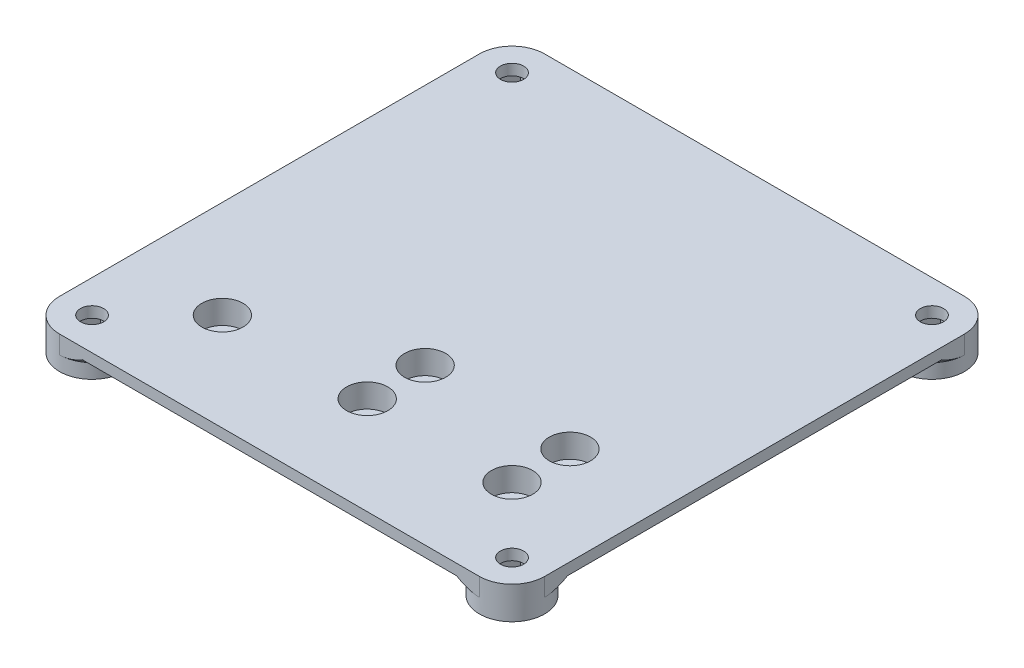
ISO-10303-21;
HEADER;
FILE_DESCRIPTION(('STEP AP214'),'2;1');
FILE_NAME('part.step','',(''),(''),'','','');
FILE_SCHEMA(('AUTOMOTIVE_DESIGN { 1 0 10303 214 1 1 1 1 }'));
ENDSEC;
DATA;
#1=APPLICATION_CONTEXT('core data for automotive mechanical design processes');
#2=APPLICATION_PROTOCOL_DEFINITION('international standard','automotive_design',2000,#1);
#3=PRODUCT_CONTEXT('',#1,'mechanical');
#4=PRODUCT('Part','Part','',(#3));
#5=PRODUCT_RELATED_PRODUCT_CATEGORY('part','',(#4));
#6=PRODUCT_DEFINITION_FORMATION('','',#4);
#7=PRODUCT_DEFINITION_CONTEXT('part definition',#1,'design');
#8=PRODUCT_DEFINITION('design','',#6,#7);
#9=PRODUCT_DEFINITION_SHAPE('','',#8);
#10=(LENGTH_UNIT() NAMED_UNIT(*) SI_UNIT(.MILLI.,.METRE.));
#11=(NAMED_UNIT(*) PLANE_ANGLE_UNIT() SI_UNIT($,.RADIAN.));
#12=(NAMED_UNIT(*) SI_UNIT($,.STERADIAN.) SOLID_ANGLE_UNIT());
#13=UNCERTAINTY_MEASURE_WITH_UNIT(LENGTH_MEASURE(1.E-05),#10,'distance_accuracy_value','');
#14=(GEOMETRIC_REPRESENTATION_CONTEXT(3) GLOBAL_UNCERTAINTY_ASSIGNED_CONTEXT((#13)) GLOBAL_UNIT_ASSIGNED_CONTEXT((#10,
#11,#12)) REPRESENTATION_CONTEXT('',''));
#15=CARTESIAN_POINT('',(0.,0.,0.));
#16=DIRECTION('',(0.,0.,1.));
#17=DIRECTION('',(1.,0.,0.));
#18=AXIS2_PLACEMENT_3D('',#15,#16,#17);
#19=CARTESIAN_POINT('',(0.,0.,0.));
#20=DIRECTION('',(0.,-1.,0.));
#21=DIRECTION('',(0.,0.,-1.));
#22=AXIS2_PLACEMENT_3D('',#19,#20,#21);
#23=PLANE('',#22);
#24=DIRECTION('',(0.,0.,1.));
#25=VECTOR('',#24,1.);
#26=CARTESIAN_POINT('',(-33.5000000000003,0.,33.5));
#27=LINE('',#26,#25);
#28=CARTESIAN_POINT('',(-33.5000000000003,0.,-25.8377223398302));
#29=VERTEX_POINT('',#28);
#30=CARTESIAN_POINT('',(-33.5000000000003,0.,25.8377223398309));
#31=VERTEX_POINT('',#30);
#32=EDGE_CURVE('E673',#29,#31,#27,.T.);
#33=ORIENTED_EDGE('',*,*,#32,.F.);
#34=CARTESIAN_POINT('',(-29.0000000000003,0.,-29.));
#35=DIRECTION('',(0.,-1.,0.));
#36=DIRECTION('',(0.,0.,-1.));
#37=AXIS2_PLACEMENT_3D('',#34,#35,#36);
#38=CIRCLE('',#37,5.50000000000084);
#39=CARTESIAN_POINT('',(-25.8377223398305,0.,-33.5));
#40=VERTEX_POINT('',#39);
#41=EDGE_CURVE('E738',#29,#40,#38,.F.);
#42=ORIENTED_EDGE('',*,*,#41,.T.);
#43=DIRECTION('',(-1.,0.,0.));
#44=VECTOR('',#43,1.);
#45=CARTESIAN_POINT('',(-33.5000000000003,0.,-33.5));
#46=LINE('',#45,#44);
#47=CARTESIAN_POINT('',(25.8377223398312,0.,-33.5));
#48=VERTEX_POINT('',#47);
#49=EDGE_CURVE('E670',#48,#40,#46,.T.);
#50=ORIENTED_EDGE('',*,*,#49,.F.);
#51=CARTESIAN_POINT('',(29.0000000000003,0.,-29.));
#52=DIRECTION('',(0.,-1.,0.));
#53=DIRECTION('',(0.,0.,-1.));
#54=AXIS2_PLACEMENT_3D('',#51,#52,#53);
#55=CIRCLE('',#54,5.50000000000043);
#56=CARTESIAN_POINT('',(33.5000000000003,0.,-25.8377223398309));
#57=VERTEX_POINT('',#56);
#58=EDGE_CURVE('E734',#48,#57,#55,.F.);
#59=ORIENTED_EDGE('',*,*,#58,.T.);
#60=DIRECTION('',(0.,0.,-1.));
#61=VECTOR('',#60,1.);
#62=CARTESIAN_POINT('',(33.5000000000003,0.,33.5));
#63=LINE('',#62,#61);
#64=CARTESIAN_POINT('',(33.5000000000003,0.,25.8377223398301));
#65=VERTEX_POINT('',#64);
#66=EDGE_CURVE('E651',#65,#57,#63,.T.);
#67=ORIENTED_EDGE('',*,*,#66,.F.);
#68=CARTESIAN_POINT('',(29.0000000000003,0.,29.));
#69=DIRECTION('',(0.,-1.,0.));
#70=DIRECTION('',(0.,0.,-1.));
#71=AXIS2_PLACEMENT_3D('',#68,#69,#70);
#72=CIRCLE('',#71,5.50000000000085);
#73=CARTESIAN_POINT('',(25.8377223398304,0.,33.5));
#74=VERTEX_POINT('',#73);
#75=EDGE_CURVE('E736',#65,#74,#72,.F.);
#76=ORIENTED_EDGE('',*,*,#75,.T.);
#77=DIRECTION('',(1.,0.,0.));
#78=VECTOR('',#77,1.);
#79=CARTESIAN_POINT('',(-33.5000000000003,0.,33.5));
#80=LINE('',#79,#78);
#81=CARTESIAN_POINT('',(-25.8377223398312,0.,33.5));
#82=VERTEX_POINT('',#81);
#83=EDGE_CURVE('E658',#82,#74,#80,.T.);
#84=ORIENTED_EDGE('',*,*,#83,.F.);
#85=CARTESIAN_POINT('',(-29.0000000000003,0.,29.));
#86=DIRECTION('',(0.,-1.,0.));
#87=DIRECTION('',(0.,0.,-1.));
#88=AXIS2_PLACEMENT_3D('',#85,#86,#87);
#89=CIRCLE('',#88,5.50000000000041);
#90=EDGE_CURVE('E732',#82,#31,#89,.F.);
#91=ORIENTED_EDGE('',*,*,#90,.T.);
#92=EDGE_LOOP('',(#33,#42,#50,#59,#67,#76,#84,#91));
#93=FACE_BOUND('',#92,.T.);
#94=DIRECTION('',(0.,0.,-1.));
#95=VECTOR('',#94,1.);
#96=CARTESIAN_POINT('',(12.2,0.,0.));
#97=LINE('',#96,#95);
#98=CARTESIAN_POINT('',(12.2,0.,5.80000000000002));
#99=VERTEX_POINT('',#98);
#100=CARTESIAN_POINT('',(12.2,0.,-27.));
#101=VERTEX_POINT('',#100);
#102=EDGE_CURVE('E1922',#99,#101,#97,.T.);
#103=ORIENTED_EDGE('',*,*,#102,.T.);
#104=DIRECTION('',(-1.,0.,0.));
#105=VECTOR('',#104,1.);
#106=CARTESIAN_POINT('',(10.,0.,-27.));
#107=LINE('',#106,#105);
#108=CARTESIAN_POINT('',(-2.19999999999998,0.,-27.));
#109=VERTEX_POINT('',#108);
#110=EDGE_CURVE('E1872',#101,#109,#107,.T.);
#111=ORIENTED_EDGE('',*,*,#110,.T.);
#112=DIRECTION('',(0.,0.,1.));
#113=VECTOR('',#112,1.);
#114=CARTESIAN_POINT('',(-2.19999999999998,0.,8.));
#115=LINE('',#114,#113);
#116=CARTESIAN_POINT('',(-2.19999999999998,0.,6.20344930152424));
#117=VERTEX_POINT('',#116);
#118=EDGE_CURVE('E1920',#109,#117,#115,.T.);
#119=ORIENTED_EDGE('',*,*,#118,.T.);
#120=CARTESIAN_POINT('',(0.,0.,12.));
#121=DIRECTION('',(0.,-1.,0.));
#122=DIRECTION('',(0.,0.,-1.));
#123=AXIS2_PLACEMENT_3D('',#120,#121,#122);
#124=CIRCLE('',#123,6.19999999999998);
#125=CARTESIAN_POINT('',(-2.30262219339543,0.,6.24344451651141));
#126=VERTEX_POINT('',#125);
#127=EDGE_CURVE('E1906',#117,#126,#124,.F.);
#128=ORIENTED_EDGE('',*,*,#127,.T.);
#129=DIRECTION('',(-0.928476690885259,0.,0.371390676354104));
#130=VECTOR('',#129,1.);
#131=CARTESIAN_POINT('',(1.83530884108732,0.,4.58827210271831));
#132=LINE('',#131,#130);
#133=CARTESIAN_POINT('',(-22.3026221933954,0.,14.2434445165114));
#134=VERTEX_POINT('',#133);
#135=EDGE_CURVE('E1904',#126,#134,#132,.T.);
#136=ORIENTED_EDGE('',*,*,#135,.T.);
#137=CARTESIAN_POINT('',(-20.,0.,20.));
#138=DIRECTION('',(0.,-1.,0.));
#139=DIRECTION('',(0.,0.,-1.));
#140=AXIS2_PLACEMENT_3D('',#137,#138,#139);
#141=CIRCLE('',#140,6.19999999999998);
#142=CARTESIAN_POINT('',(-20.,0.,26.2));
#143=VERTEX_POINT('',#142);
#144=EDGE_CURVE('E1908',#134,#143,#141,.F.);
#145=ORIENTED_EDGE('',*,*,#144,.T.);
#146=DIRECTION('',(1.,0.,0.));
#147=VECTOR('',#146,1.);
#148=CARTESIAN_POINT('',(0.,0.,26.2));
#149=LINE('',#148,#147);
#150=CARTESIAN_POINT('',(20.,0.,26.2));
#151=VERTEX_POINT('',#150);
#152=EDGE_CURVE('E1910',#143,#151,#149,.T.);
#153=ORIENTED_EDGE('',*,*,#152,.T.);
#154=CARTESIAN_POINT('',(20.,0.,20.));
#155=DIRECTION('',(0.,-1.,0.));
#156=DIRECTION('',(0.,0.,-1.));
#157=AXIS2_PLACEMENT_3D('',#154,#155,#156);
#158=CIRCLE('',#157,6.19999999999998);
#159=CARTESIAN_POINT('',(26.2,0.,20.));
#160=VERTEX_POINT('',#159);
#161=EDGE_CURVE('E1912',#151,#160,#158,.F.);
#162=ORIENTED_EDGE('',*,*,#161,.T.);
#163=DIRECTION('',(0.,0.,-1.));
#164=VECTOR('',#163,1.);
#165=CARTESIAN_POINT('',(26.2,0.,0.));
#166=LINE('',#165,#164);
#167=CARTESIAN_POINT('',(26.2,0.,12.));
#168=VERTEX_POINT('',#167);
#169=EDGE_CURVE('E1914',#160,#168,#166,.T.);
#170=ORIENTED_EDGE('',*,*,#169,.T.);
#171=CARTESIAN_POINT('',(20.,0.,12.));
#172=DIRECTION('',(0.,-1.,0.));
#173=DIRECTION('',(0.,0.,-1.));
#174=AXIS2_PLACEMENT_3D('',#171,#172,#173);
#175=CIRCLE('',#174,6.19999999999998);
#176=CARTESIAN_POINT('',(20.,0.,5.80000000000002));
#177=VERTEX_POINT('',#176);
#178=EDGE_CURVE('E1916',#168,#177,#175,.F.);
#179=ORIENTED_EDGE('',*,*,#178,.T.);
#180=DIRECTION('',(-1.,0.,0.));
#181=VECTOR('',#180,1.);
#182=CARTESIAN_POINT('',(0.,0.,5.80000000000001));
#183=LINE('',#182,#181);
#184=EDGE_CURVE('E1918',#177,#99,#183,.T.);
#185=ORIENTED_EDGE('',*,*,#184,.T.);
#186=EDGE_LOOP('',(#103,#111,#119,#128,#136,#145,#153,#162,#170,#179,#185));
#187=FACE_BOUND('',#186,.T.);
#188=ADVANCED_FACE('F43',(#93,#187),#23,.T.);
#189=CARTESIAN_POINT('',(20.,-8.,8.));
#190=DIRECTION('',(0.,0.,1.));
#191=DIRECTION('',(1.,0.,0.));
#192=AXIS2_PLACEMENT_3D('',#189,#190,#191);
#193=PLANE('',#192);
#194=DIRECTION('',(1.,0.,0.));
#195=VECTOR('',#194,1.);
#196=CARTESIAN_POINT('',(20.,-8.,8.));
#197=LINE('',#196,#195);
#198=CARTESIAN_POINT('',(12.2,-8.,8.));
#199=VERTEX_POINT('',#198);
#200=CARTESIAN_POINT('',(20.,-8.,8.));
#201=VERTEX_POINT('',#200);
#202=EDGE_CURVE('E594',#199,#201,#197,.T.);
#203=ORIENTED_EDGE('',*,*,#202,.F.);
#204=DIRECTION('',(0.,1.,0.));
#205=VECTOR('',#204,1.);
#206=CARTESIAN_POINT('',(12.2,0.,8.));
#207=LINE('',#206,#205);
#208=CARTESIAN_POINT('',(12.2,-2.19999999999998,8.));
#209=VERTEX_POINT('',#208);
#210=EDGE_CURVE('E1902',#199,#209,#207,.T.);
#211=ORIENTED_EDGE('',*,*,#210,.T.);
#212=DIRECTION('',(1.,0.,0.));
#213=VECTOR('',#212,1.);
#214=CARTESIAN_POINT('',(20.,-2.19999999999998,8.));
#215=LINE('',#214,#213);
#216=CARTESIAN_POINT('',(20.,-2.19999999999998,8.));
#217=VERTEX_POINT('',#216);
#218=EDGE_CURVE('E1897',#209,#217,#215,.T.);
#219=ORIENTED_EDGE('',*,*,#218,.T.);
#220=DIRECTION('',(0.,1.,0.));
#221=VECTOR('',#220,1.);
#222=CARTESIAN_POINT('',(20.,-8.,8.));
#223=LINE('',#222,#221);
#224=EDGE_CURVE('E626',#201,#217,#223,.T.);
#225=ORIENTED_EDGE('',*,*,#224,.F.);
#226=EDGE_LOOP('',(#203,#211,#219,#225));
#227=FACE_BOUND('',#226,.T.);
#228=ADVANCED_FACE('F945',(#227),#193,.F.);
#229=DIRECTION('',(0.5,0.,0.866025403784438));
#230=VECTOR('',#229,1.);
#231=CARTESIAN_POINT('',(-27.4267205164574,0.,-31.725));
#232=LINE('',#231,#230);
#233=CARTESIAN_POINT('',(-27.4267205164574,0.,-31.725));
#234=VERTEX_POINT('',#233);
#235=CARTESIAN_POINT('',(-25.8534410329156,0.,-29.));
#236=VERTEX_POINT('',#235);
#237=EDGE_CURVE('E412',#234,#236,#232,.T.);
#238=ORIENTED_EDGE('',*,*,#237,.T.);
#239=DIRECTION('',(-0.5,0.,0.866025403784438));
#240=VECTOR('',#239,1.);
#241=CARTESIAN_POINT('',(-25.8534410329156,0.,-29.));
#242=LINE('',#241,#240);
#243=CARTESIAN_POINT('',(-27.4267205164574,0.,-26.275));
#244=VERTEX_POINT('',#243);
#245=EDGE_CURVE('E1855',#236,#244,#242,.T.);
#246=ORIENTED_EDGE('',*,*,#245,.T.);
#247=DIRECTION('',(-1.,0.,0.));
#248=VECTOR('',#247,1.);
#249=CARTESIAN_POINT('',(-27.4267205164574,0.,-26.275));
#250=LINE('',#249,#248);
#251=CARTESIAN_POINT('',(-30.5732794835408,0.,-26.275));
#252=VERTEX_POINT('',#251);
#253=EDGE_CURVE('E1852',#244,#252,#250,.T.);
#254=ORIENTED_EDGE('',*,*,#253,.T.);
#255=DIRECTION('',(-0.5,0.,-0.866025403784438));
#256=VECTOR('',#255,1.);
#257=CARTESIAN_POINT('',(-30.5732794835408,0.,-26.275));
#258=LINE('',#257,#256);
#259=CARTESIAN_POINT('',(-32.1465589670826,0.,-29.));
#260=VERTEX_POINT('',#259);
#261=EDGE_CURVE('E1849',#252,#260,#258,.T.);
#262=ORIENTED_EDGE('',*,*,#261,.T.);
#263=DIRECTION('',(0.5,0.,-0.866025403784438));
#264=VECTOR('',#263,1.);
#265=CARTESIAN_POINT('',(-32.1465589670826,0.,-29.));
#266=LINE('',#265,#264);
#267=CARTESIAN_POINT('',(-30.5732794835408,0.,-31.725));
#268=VERTEX_POINT('',#267);
#269=EDGE_CURVE('E1853',#260,#268,#266,.T.);
#270=ORIENTED_EDGE('',*,*,#269,.T.);
#271=DIRECTION('',(1.,0.,0.));
#272=VECTOR('',#271,1.);
#273=CARTESIAN_POINT('',(-30.5732794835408,0.,-31.725));
#274=LINE('',#273,#272);
#275=EDGE_CURVE('E390',#268,#234,#274,.T.);
#276=ORIENTED_EDGE('',*,*,#275,.T.);
#277=EDGE_LOOP('',(#238,#246,#254,#262,#270,#276));
#278=FACE_BOUND('',#277,.T.);
#279=CARTESIAN_POINT('',(-29.0000000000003,0.,-29.));
#280=DIRECTION('',(0.,1.,0.));
#281=DIRECTION('',(0.,0.,1.));
#282=AXIS2_PLACEMENT_3D('',#279,#280,#281);
#283=CIRCLE('',#282,1.6);
#284=CARTESIAN_POINT('',(-29.0000000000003,0.,-27.4));
#285=VERTEX_POINT('',#284);
#286=EDGE_CURVE('E645',#285,#285,#283,.T.);
#287=ORIENTED_EDGE('',*,*,#286,.T.);
#288=EDGE_LOOP('',(#287));
#289=FACE_BOUND('',#288,.T.);
#290=ADVANCED_FACE('F947',(#278,#289),#23,.T.);
#291=DIRECTION('',(0.5,0.,0.866025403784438));
#292=VECTOR('',#291,1.);
#293=CARTESIAN_POINT('',(30.5732794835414,0.,-31.725));
#294=LINE('',#293,#292);
#295=CARTESIAN_POINT('',(30.5732794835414,0.,-31.725));
#296=VERTEX_POINT('',#295);
#297=CARTESIAN_POINT('',(32.1465589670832,0.,-29.));
#298=VERTEX_POINT('',#297);
#299=EDGE_CURVE('E454',#296,#298,#294,.T.);
#300=ORIENTED_EDGE('',*,*,#299,.T.);
#301=DIRECTION('',(-0.5,0.,0.866025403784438));
#302=VECTOR('',#301,1.);
#303=CARTESIAN_POINT('',(32.1465589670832,0.,-29.));
#304=LINE('',#303,#302);
#305=CARTESIAN_POINT('',(30.5732794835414,0.,-26.275));
#306=VERTEX_POINT('',#305);
#307=EDGE_CURVE('E452',#298,#306,#304,.T.);
#308=ORIENTED_EDGE('',*,*,#307,.T.);
#309=DIRECTION('',(-1.,0.,0.));
#310=VECTOR('',#309,1.);
#311=CARTESIAN_POINT('',(30.5732794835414,0.,-26.275));
#312=LINE('',#311,#310);
#313=CARTESIAN_POINT('',(27.426720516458,0.,-26.275));
#314=VERTEX_POINT('',#313);
#315=EDGE_CURVE('E450',#306,#314,#312,.T.);
#316=ORIENTED_EDGE('',*,*,#315,.T.);
#317=DIRECTION('',(-0.5,0.,-0.866025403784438));
#318=VECTOR('',#317,1.);
#319=CARTESIAN_POINT('',(27.426720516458,0.,-26.275));
#320=LINE('',#319,#318);
#321=CARTESIAN_POINT('',(25.8534410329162,0.,-29.));
#322=VERTEX_POINT('',#321);
#323=EDGE_CURVE('E448',#314,#322,#320,.T.);
#324=ORIENTED_EDGE('',*,*,#323,.T.);
#325=DIRECTION('',(0.5,0.,-0.866025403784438));
#326=VECTOR('',#325,1.);
#327=CARTESIAN_POINT('',(25.8534410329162,0.,-29.));
#328=LINE('',#327,#326);
#329=CARTESIAN_POINT('',(27.426720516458,0.,-31.725));
#330=VERTEX_POINT('',#329);
#331=EDGE_CURVE('E445',#322,#330,#328,.T.);
#332=ORIENTED_EDGE('',*,*,#331,.T.);
#333=DIRECTION('',(1.,0.,0.));
#334=VECTOR('',#333,1.);
#335=CARTESIAN_POINT('',(27.426720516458,0.,-31.725));
#336=LINE('',#335,#334);
#337=EDGE_CURVE('E443',#330,#296,#336,.T.);
#338=ORIENTED_EDGE('',*,*,#337,.T.);
#339=EDGE_LOOP('',(#300,#308,#316,#324,#332,#338));
#340=FACE_BOUND('',#339,.T.);
#341=CARTESIAN_POINT('',(28.9999999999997,0.,-29.));
#342=DIRECTION('',(0.,1.,0.));
#343=DIRECTION('',(0.,0.,1.));
#344=AXIS2_PLACEMENT_3D('',#341,#342,#343);
#345=CIRCLE('',#344,1.6);
#346=CARTESIAN_POINT('',(28.9999999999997,0.,-27.4));
#347=VERTEX_POINT('',#346);
#348=EDGE_CURVE('E639',#347,#347,#345,.T.);
#349=ORIENTED_EDGE('',*,*,#348,.T.);
#350=EDGE_LOOP('',(#349));
#351=FACE_BOUND('',#350,.T.);
#352=ADVANCED_FACE('F956',(#340,#351),#23,.T.);
#353=DIRECTION('',(0.5,0.,0.866025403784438));
#354=VECTOR('',#353,1.);
#355=CARTESIAN_POINT('',(30.5732794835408,0.,26.275));
#356=LINE('',#355,#354);
#357=CARTESIAN_POINT('',(30.5732794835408,0.,26.275));
#358=VERTEX_POINT('',#357);
#359=CARTESIAN_POINT('',(32.1465589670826,0.,29.));
#360=VERTEX_POINT('',#359);
#361=EDGE_CURVE('E500',#358,#360,#356,.T.);
#362=ORIENTED_EDGE('',*,*,#361,.T.);
#363=DIRECTION('',(-0.5,0.,0.866025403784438));
#364=VECTOR('',#363,1.);
#365=CARTESIAN_POINT('',(32.1465589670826,0.,29.));
#366=LINE('',#365,#364);
#367=CARTESIAN_POINT('',(30.5732794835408,0.,31.725));
#368=VERTEX_POINT('',#367);
#369=EDGE_CURVE('E498',#360,#368,#366,.T.);
#370=ORIENTED_EDGE('',*,*,#369,.T.);
#371=DIRECTION('',(-1.,0.,0.));
#372=VECTOR('',#371,1.);
#373=CARTESIAN_POINT('',(30.5732794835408,0.,31.725));
#374=LINE('',#373,#372);
#375=CARTESIAN_POINT('',(27.4267205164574,0.,31.725));
#376=VERTEX_POINT('',#375);
#377=EDGE_CURVE('E496',#368,#376,#374,.T.);
#378=ORIENTED_EDGE('',*,*,#377,.T.);
#379=DIRECTION('',(-0.5,0.,-0.866025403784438));
#380=VECTOR('',#379,1.);
#381=CARTESIAN_POINT('',(27.4267205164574,0.,31.725));
#382=LINE('',#381,#380);
#383=CARTESIAN_POINT('',(25.8534410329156,0.,29.));
#384=VERTEX_POINT('',#383);
#385=EDGE_CURVE('E494',#376,#384,#382,.T.);
#386=ORIENTED_EDGE('',*,*,#385,.T.);
#387=DIRECTION('',(0.5,0.,-0.866025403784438));
#388=VECTOR('',#387,1.);
#389=CARTESIAN_POINT('',(25.8534410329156,0.,29.));
#390=LINE('',#389,#388);
#391=CARTESIAN_POINT('',(27.4267205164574,0.,26.275));
#392=VERTEX_POINT('',#391);
#393=EDGE_CURVE('E491',#384,#392,#390,.T.);
#394=ORIENTED_EDGE('',*,*,#393,.T.);
#395=DIRECTION('',(1.,0.,0.));
#396=VECTOR('',#395,1.);
#397=CARTESIAN_POINT('',(27.4267205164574,0.,26.275));
#398=LINE('',#397,#396);
#399=EDGE_CURVE('E489',#392,#358,#398,.T.);
#400=ORIENTED_EDGE('',*,*,#399,.T.);
#401=EDGE_LOOP('',(#362,#370,#378,#386,#394,#400));
#402=FACE_BOUND('',#401,.T.);
#403=CARTESIAN_POINT('',(29.0000000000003,0.,29.));
#404=DIRECTION('',(0.,1.,0.));
#405=DIRECTION('',(0.,0.,1.));
#406=AXIS2_PLACEMENT_3D('',#403,#404,#405);
#407=CIRCLE('',#406,1.6);
#408=CARTESIAN_POINT('',(29.0000000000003,0.,30.6));
#409=VERTEX_POINT('',#408);
#410=EDGE_CURVE('E633',#409,#409,#407,.T.);
#411=ORIENTED_EDGE('',*,*,#410,.T.);
#412=EDGE_LOOP('',(#411));
#413=FACE_BOUND('',#412,.T.);
#414=ADVANCED_FACE('F962',(#402,#413),#23,.T.);
#415=CARTESIAN_POINT('',(0.,1.5,0.));
#416=DIRECTION('',(0.,-1.,0.));
#417=DIRECTION('',(0.,0.,-1.));
#418=AXIS2_PLACEMENT_3D('',#415,#416,#417);
#419=PLANE('',#418);
#420=CARTESIAN_POINT('',(-20.,1.5,20.));
#421=DIRECTION('',(0.,-1.,0.));
#422=DIRECTION('',(0.,0.,-1.));
#423=AXIS2_PLACEMENT_3D('',#420,#421,#422);
#424=CIRCLE('',#423,2.85);
#425=CARTESIAN_POINT('',(-20.,1.5,17.15));
#426=VERTEX_POINT('',#425);
#427=EDGE_CURVE('E579',#426,#426,#424,.T.);
#428=ORIENTED_EDGE('',*,*,#427,.T.);
#429=EDGE_LOOP('',(#428));
#430=FACE_BOUND('',#429,.T.);
#431=CARTESIAN_POINT('',(0.,1.5,20.));
#432=DIRECTION('',(0.,-1.,0.));
#433=DIRECTION('',(0.,0.,-1.));
#434=AXIS2_PLACEMENT_3D('',#431,#432,#433);
#435=CIRCLE('',#434,2.85);
#436=CARTESIAN_POINT('',(0.,1.5,17.15));
#437=VERTEX_POINT('',#436);
#438=EDGE_CURVE('E701',#437,#437,#435,.T.);
#439=ORIENTED_EDGE('',*,*,#438,.T.);
#440=EDGE_LOOP('',(#439));
#441=FACE_BOUND('',#440,.T.);
#442=CARTESIAN_POINT('',(0.,1.5,12.));
#443=DIRECTION('',(0.,-1.,0.));
#444=DIRECTION('',(0.,0.,-1.));
#445=AXIS2_PLACEMENT_3D('',#442,#443,#444);
#446=CIRCLE('',#445,2.85);
#447=CARTESIAN_POINT('',(0.,1.5,9.15));
#448=VERTEX_POINT('',#447);
#449=EDGE_CURVE('E698',#448,#448,#446,.T.);
#450=ORIENTED_EDGE('',*,*,#449,.T.);
#451=EDGE_LOOP('',(#450));
#452=FACE_BOUND('',#451,.T.);
#453=CARTESIAN_POINT('',(20.,1.5,12.));
#454=DIRECTION('',(0.,-1.,0.));
#455=DIRECTION('',(0.,0.,-1.));
#456=AXIS2_PLACEMENT_3D('',#453,#454,#455);
#457=CIRCLE('',#456,2.85);
#458=CARTESIAN_POINT('',(20.,1.5,9.15));
#459=VERTEX_POINT('',#458);
#460=EDGE_CURVE('E695',#459,#459,#457,.T.);
#461=ORIENTED_EDGE('',*,*,#460,.T.);
#462=EDGE_LOOP('',(#461));
#463=FACE_BOUND('',#462,.T.);
#464=CARTESIAN_POINT('',(20.,1.5,20.));
#465=DIRECTION('',(0.,-1.,0.));
#466=DIRECTION('',(0.,0.,-1.));
#467=AXIS2_PLACEMENT_3D('',#464,#465,#466);
#468=CIRCLE('',#467,2.85);
#469=CARTESIAN_POINT('',(20.,1.5,17.15));
#470=VERTEX_POINT('',#469);
#471=EDGE_CURVE('E692',#470,#470,#468,.T.);
#472=ORIENTED_EDGE('',*,*,#471,.T.);
#473=EDGE_LOOP('',(#472));
#474=FACE_BOUND('',#473,.T.);
#475=DIRECTION('',(1.,0.,0.));
#476=VECTOR('',#475,1.);
#477=CARTESIAN_POINT('',(-33.5000000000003,1.5,33.5));
#478=LINE('',#477,#476);
#479=CARTESIAN_POINT('',(-29.0000000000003,1.5,33.5));
#480=VERTEX_POINT('',#479);
#481=CARTESIAN_POINT('',(29.0000000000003,1.5,33.5));
#482=VERTEX_POINT('',#481);
#483=EDGE_CURVE('E664',#480,#482,#478,.T.);
#484=ORIENTED_EDGE('',*,*,#483,.T.);
#485=CARTESIAN_POINT('',(29.0000000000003,1.5,29.));
#486=DIRECTION('',(0.,-1.,0.));
#487=DIRECTION('',(0.,0.,-1.));
#488=AXIS2_PLACEMENT_3D('',#485,#486,#487);
#489=CIRCLE('',#488,4.5);
#490=CARTESIAN_POINT('',(33.5000000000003,1.5,29.));
#491=VERTEX_POINT('',#490);
#492=EDGE_CURVE('E719',#482,#491,#489,.F.);
#493=ORIENTED_EDGE('',*,*,#492,.T.);
#494=DIRECTION('',(0.,0.,-1.));
#495=VECTOR('',#494,1.);
#496=CARTESIAN_POINT('',(33.5000000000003,1.5,33.5));
#497=LINE('',#496,#495);
#498=CARTESIAN_POINT('',(33.5000000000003,1.5,-29.));
#499=VERTEX_POINT('',#498);
#500=EDGE_CURVE('E654',#491,#499,#497,.T.);
#501=ORIENTED_EDGE('',*,*,#500,.T.);
#502=CARTESIAN_POINT('',(29.0000000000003,1.5,-29.));
#503=DIRECTION('',(0.,-1.,0.));
#504=DIRECTION('',(0.,0.,-1.));
#505=AXIS2_PLACEMENT_3D('',#502,#503,#504);
#506=CIRCLE('',#505,4.5);
#507=CARTESIAN_POINT('',(29.0000000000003,1.5,-33.5));
#508=VERTEX_POINT('',#507);
#509=EDGE_CURVE('E717',#499,#508,#506,.F.);
#510=ORIENTED_EDGE('',*,*,#509,.T.);
#511=DIRECTION('',(-1.,0.,0.));
#512=VECTOR('',#511,1.);
#513=CARTESIAN_POINT('',(-33.5000000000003,1.5,-33.5));
#514=LINE('',#513,#512);
#515=CARTESIAN_POINT('',(-29.0000000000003,1.5,-33.5));
#516=VERTEX_POINT('',#515);
#517=EDGE_CURVE('E657',#508,#516,#514,.T.);
#518=ORIENTED_EDGE('',*,*,#517,.T.);
#519=CARTESIAN_POINT('',(-29.0000000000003,1.5,-29.));
#520=DIRECTION('',(0.,-1.,0.));
#521=DIRECTION('',(0.,0.,-1.));
#522=AXIS2_PLACEMENT_3D('',#519,#520,#521);
#523=CIRCLE('',#522,4.5);
#524=CARTESIAN_POINT('',(-33.5000000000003,1.5,-29.));
#525=VERTEX_POINT('',#524);
#526=EDGE_CURVE('E715',#516,#525,#523,.F.);
#527=ORIENTED_EDGE('',*,*,#526,.T.);
#528=DIRECTION('',(0.,0.,1.));
#529=VECTOR('',#528,1.);
#530=CARTESIAN_POINT('',(-33.5000000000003,1.5,33.5));
#531=LINE('',#530,#529);
#532=CARTESIAN_POINT('',(-33.5000000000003,1.5,29.));
#533=VERTEX_POINT('',#532);
#534=EDGE_CURVE('E661',#525,#533,#531,.T.);
#535=ORIENTED_EDGE('',*,*,#534,.T.);
#536=CARTESIAN_POINT('',(-29.0000000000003,1.5,29.));
#537=DIRECTION('',(0.,-1.,0.));
#538=DIRECTION('',(0.,0.,-1.));
#539=AXIS2_PLACEMENT_3D('',#536,#537,#538);
#540=CIRCLE('',#539,4.5);
#541=EDGE_CURVE('E713',#533,#480,#540,.F.);
#542=ORIENTED_EDGE('',*,*,#541,.T.);
#543=EDGE_LOOP('',(#484,#493,#501,#510,#518,#527,#535,#542));
#544=FACE_BOUND('',#543,.T.);
#545=CARTESIAN_POINT('',(-29.0000000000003,1.5,-29.));
#546=DIRECTION('',(0.,1.,0.));
#547=DIRECTION('',(0.,0.,1.));
#548=AXIS2_PLACEMENT_3D('',#545,#546,#547);
#549=CIRCLE('',#548,1.6);
#550=CARTESIAN_POINT('',(-29.0000000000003,1.5,-27.4));
#551=VERTEX_POINT('',#550);
#552=EDGE_CURVE('E648',#551,#551,#549,.T.);
#553=ORIENTED_EDGE('',*,*,#552,.F.);
#554=EDGE_LOOP('',(#553));
#555=FACE_BOUND('',#554,.T.);
#556=CARTESIAN_POINT('',(28.9999999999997,1.5,-29.));
#557=DIRECTION('',(0.,1.,0.));
#558=DIRECTION('',(0.,0.,1.));
#559=AXIS2_PLACEMENT_3D('',#556,#557,#558);
#560=CIRCLE('',#559,1.6);
#561=CARTESIAN_POINT('',(28.9999999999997,1.5,-27.4));
#562=VERTEX_POINT('',#561);
#563=EDGE_CURVE('E642',#562,#562,#560,.T.);
#564=ORIENTED_EDGE('',*,*,#563,.F.);
#565=EDGE_LOOP('',(#564));
#566=FACE_BOUND('',#565,.T.);
#567=CARTESIAN_POINT('',(29.0000000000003,1.5,29.));
#568=DIRECTION('',(0.,1.,0.));
#569=DIRECTION('',(0.,0.,1.));
#570=AXIS2_PLACEMENT_3D('',#567,#568,#569);
#571=CIRCLE('',#570,1.6);
#572=CARTESIAN_POINT('',(29.0000000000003,1.5,30.6));
#573=VERTEX_POINT('',#572);
#574=EDGE_CURVE('E636',#573,#573,#571,.T.);
#575=ORIENTED_EDGE('',*,*,#574,.F.);
#576=EDGE_LOOP('',(#575));
#577=FACE_BOUND('',#576,.T.);
#578=CARTESIAN_POINT('',(-28.9999999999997,1.5,29.));
#579=DIRECTION('',(0.,1.,0.));
#580=DIRECTION('',(0.,0.,1.));
#581=AXIS2_PLACEMENT_3D('',#578,#579,#580);
#582=CIRCLE('',#581,1.6);
#583=CARTESIAN_POINT('',(-28.9999999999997,1.5,30.6));
#584=VERTEX_POINT('',#583);
#585=EDGE_CURVE('E630',#584,#584,#582,.T.);
#586=ORIENTED_EDGE('',*,*,#585,.F.);
#587=EDGE_LOOP('',(#586));
#588=FACE_BOUND('',#587,.T.);
#589=ADVANCED_FACE('F960',(#430,#441,#452,#463,#474,#544,#555,#566,#577,#588),#419,.F.);
#590=DIRECTION('',(0.5,0.,0.866025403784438));
#591=VECTOR('',#590,1.);
#592=CARTESIAN_POINT('',(-27.426720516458,0.,26.275));
#593=LINE('',#592,#591);
#594=CARTESIAN_POINT('',(-27.426720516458,0.,26.275));
#595=VERTEX_POINT('',#594);
#596=CARTESIAN_POINT('',(-25.8534410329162,0.,29.));
#597=VERTEX_POINT('',#596);
#598=EDGE_CURVE('E502',#595,#597,#593,.T.);
#599=ORIENTED_EDGE('',*,*,#598,.T.);
#600=DIRECTION('',(-0.5,0.,0.866025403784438));
#601=VECTOR('',#600,1.);
#602=CARTESIAN_POINT('',(-25.8534410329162,0.,29.));
#603=LINE('',#602,#601);
#604=CARTESIAN_POINT('',(-27.426720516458,0.,31.725));
#605=VERTEX_POINT('',#604);
#606=EDGE_CURVE('E530',#597,#605,#603,.T.);
#607=ORIENTED_EDGE('',*,*,#606,.T.);
#608=DIRECTION('',(-1.,0.,0.));
#609=VECTOR('',#608,1.);
#610=CARTESIAN_POINT('',(-27.426720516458,0.,31.725));
#611=LINE('',#610,#609);
#612=CARTESIAN_POINT('',(-30.5732794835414,0.,31.725));
#613=VERTEX_POINT('',#612);
#614=EDGE_CURVE('E532',#605,#613,#611,.T.);
#615=ORIENTED_EDGE('',*,*,#614,.T.);
#616=DIRECTION('',(-0.5,0.,-0.866025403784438));
#617=VECTOR('',#616,1.);
#618=CARTESIAN_POINT('',(-30.5732794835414,0.,31.725));
#619=LINE('',#618,#617);
#620=CARTESIAN_POINT('',(-32.1465589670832,0.,29.));
#621=VERTEX_POINT('',#620);
#622=EDGE_CURVE('E534',#613,#621,#619,.T.);
#623=ORIENTED_EDGE('',*,*,#622,.T.);
#624=DIRECTION('',(0.5,0.,-0.866025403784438));
#625=VECTOR('',#624,1.);
#626=CARTESIAN_POINT('',(-32.1465589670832,0.,29.));
#627=LINE('',#626,#625);
#628=CARTESIAN_POINT('',(-30.5732794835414,0.,26.275));
#629=VERTEX_POINT('',#628);
#630=EDGE_CURVE('E536',#621,#629,#627,.T.);
#631=ORIENTED_EDGE('',*,*,#630,.T.);
#632=DIRECTION('',(1.,0.,0.));
#633=VECTOR('',#632,1.);
#634=CARTESIAN_POINT('',(-30.5732794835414,0.,26.275));
#635=LINE('',#634,#633);
#636=EDGE_CURVE('E517',#629,#595,#635,.T.);
#637=ORIENTED_EDGE('',*,*,#636,.T.);
#638=EDGE_LOOP('',(#599,#607,#615,#623,#631,#637));
#639=FACE_BOUND('',#638,.T.);
#640=CARTESIAN_POINT('',(-28.9999999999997,0.,29.));
#641=DIRECTION('',(0.,1.,0.));
#642=DIRECTION('',(0.,0.,1.));
#643=AXIS2_PLACEMENT_3D('',#640,#641,#642);
#644=CIRCLE('',#643,1.6);
#645=CARTESIAN_POINT('',(-28.9999999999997,0.,30.6));
#646=VERTEX_POINT('',#645);
#647=EDGE_CURVE('E629',#646,#646,#644,.T.);
#648=ORIENTED_EDGE('',*,*,#647,.T.);
#649=EDGE_LOOP('',(#648));
#650=FACE_BOUND('',#649,.T.);
#651=ADVANCED_FACE('F818',(#639,#650),#23,.T.);
#652=CARTESIAN_POINT('',(33.5000000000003,1.5,33.5));
#653=DIRECTION('',(-1.,0.,0.));
#654=DIRECTION('',(0.,0.,1.));
#655=AXIS2_PLACEMENT_3D('',#652,#653,#654);
#656=PLANE('',#655);
#657=ORIENTED_EDGE('',*,*,#500,.F.);
#658=DIRECTION('',(0.,-1.,0.));
#659=VECTOR('',#658,1.);
#660=CARTESIAN_POINT('',(33.5000000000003,1.5,29.));
#661=LINE('',#660,#659);
#662=CARTESIAN_POINT('',(33.5000000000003,-1.00000000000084,29.));
#663=VERTEX_POINT('',#662);
#664=EDGE_CURVE('E707',#491,#663,#661,.T.);
#665=ORIENTED_EDGE('',*,*,#664,.T.);
#666=CARTESIAN_POINT('',(33.5000000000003,-1.00000000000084,29.));
#667=CARTESIAN_POINT('',(33.5000000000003,-1.00000556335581,28.9308365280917));
#668=CARTESIAN_POINT('',(33.5000000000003,-0.998404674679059,28.8616833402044));
#669=CARTESIAN_POINT('',(33.5000000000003,-0.992042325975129,28.7235332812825));
#670=CARTESIAN_POINT('',(33.5000000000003,-0.987281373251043,28.654536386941));
#671=CARTESIAN_POINT('',(33.5000000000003,-0.968362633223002,28.4482396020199));
#672=CARTESIAN_POINT('',(33.5000000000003,-0.949568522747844,28.3113421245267));
#673=CARTESIAN_POINT('',(33.5000000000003,-0.901009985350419,28.0418678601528));
#674=CARTESIAN_POINT('',(33.5000000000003,-0.871429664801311,27.9092570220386));
#675=CARTESIAN_POINT('',(33.5000000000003,-0.802579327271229,27.6465440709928));
#676=CARTESIAN_POINT('',(33.5000000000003,-0.763305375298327,27.5164430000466));
#677=CARTESIAN_POINT('',(33.5000000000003,-0.67471222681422,27.2537685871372));
#678=CARTESIAN_POINT('',(33.5000000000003,-0.625046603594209,27.1213132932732));
#679=CARTESIAN_POINT('',(33.5000000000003,-0.518261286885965,26.859435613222));
#680=CARTESIAN_POINT('',(33.5000000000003,-0.46113993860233,26.7300139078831));
#681=CARTESIAN_POINT('',(33.5000000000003,-0.339692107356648,26.4717538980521));
#682=CARTESIAN_POINT('',(33.5000000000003,-0.275253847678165,26.3429686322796));
#683=CARTESIAN_POINT('',(33.5000000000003,-0.141224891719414,26.0882862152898));
#684=CARTESIAN_POINT('',(33.5000000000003,-0.0716401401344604,25.9623859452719));
#685=CARTESIAN_POINT('',(33.5000000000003,0.,25.8377223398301));
#686=B_SPLINE_CURVE_WITH_KNOTS('',3,(#666,#667,#668,#669,#670,#671,#672,#673,#674,#675,#676,
#677,#678,#679,#680,#681,#682,#683,#684,#685),.UNSPECIFIED.,.F.,.F.,(4,2,2,2,2,2,2,2,2,4),(0.,
0.207452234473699,0.414871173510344,0.828837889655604,1.2360463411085,1.64342036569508,
2.06753203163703,2.49173798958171,2.92362845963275,3.35502761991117),.UNSPECIFIED.);
#687=EDGE_CURVE('E792',#663,#65,#686,.T.);
#688=ORIENTED_EDGE('',*,*,#687,.T.);
#689=ORIENTED_EDGE('',*,*,#66,.T.);
#690=CARTESIAN_POINT('',(33.5000000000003,0.,-25.8377223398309));
#691=CARTESIAN_POINT('',(33.5000000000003,-0.0455939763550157,-25.9170299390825));
#692=CARTESIAN_POINT('',(33.5000000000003,-0.0903316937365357,-25.9968284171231));
#693=CARTESIAN_POINT('',(33.5000000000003,-0.177858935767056,-26.1575123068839));
#694=CARTESIAN_POINT('',(33.5000000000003,-0.220647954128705,-26.2383979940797));
#695=CARTESIAN_POINT('',(33.5000000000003,-0.345989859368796,-26.483341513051));
#696=CARTESIAN_POINT('',(33.5000000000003,-0.425200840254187,-26.6491420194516));
#697=CARTESIAN_POINT('',(33.5000000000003,-0.570274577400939,-26.9815872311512));
#698=CARTESIAN_POINT('',(33.5000000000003,-0.636422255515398,-27.1481065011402));
#699=CARTESIAN_POINT('',(33.5000000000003,-0.754727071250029,-27.4858852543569));
#700=CARTESIAN_POINT('',(33.5000000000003,-0.806905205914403,-27.6571371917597));
#701=CARTESIAN_POINT('',(33.5000000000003,-0.87438568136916,-27.9254064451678));
#702=CARTESIAN_POINT('',(33.5000000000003,-0.895687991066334,-28.0209303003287));
#703=CARTESIAN_POINT('',(33.5000000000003,-0.932683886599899,-28.2130678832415));
#704=CARTESIAN_POINT('',(33.5000000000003,-0.948377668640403,-28.3096815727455));
#705=CARTESIAN_POINT('',(33.5000000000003,-0.973903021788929,-28.5049961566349));
#706=CARTESIAN_POINT('',(33.5000000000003,-0.983653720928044,-28.6037077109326));
#707=CARTESIAN_POINT('',(33.5000000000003,-0.996720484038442,-28.8016078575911));
#708=CARTESIAN_POINT('',(33.5000000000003,-1.00003301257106,-28.9007966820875));
#709=CARTESIAN_POINT('',(33.5000000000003,-1.00000000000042,-29.));
#710=B_SPLINE_CURVE_WITH_KNOTS('',3,(#690,#691,#692,#693,#694,#695,#696,#697,#698,#699,#700,
#701,#702,#703,#704,#705,#706,#707,#708,#709),.UNSPECIFIED.,.F.,.F.,(4,2,2,2,2,2,2,2,2,4),(0.,
0.274427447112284,0.548925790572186,1.099808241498,1.63687617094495,2.17313226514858,
2.46660156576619,2.7600605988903,3.05742864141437,3.35495993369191),.UNSPECIFIED.);
#711=CARTESIAN_POINT('',(33.5000000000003,-1.00000000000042,-29.));
#712=VERTEX_POINT('',#711);
#713=EDGE_CURVE('E829',#57,#712,#710,.T.);
#714=ORIENTED_EDGE('',*,*,#713,.T.);
#715=DIRECTION('',(0.,-1.,0.));
#716=VECTOR('',#715,1.);
#717=CARTESIAN_POINT('',(33.5000000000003,1.5,-29.));
#718=LINE('',#717,#716);
#719=EDGE_CURVE('E667',#712,#499,#718,.F.);
#720=ORIENTED_EDGE('',*,*,#719,.T.);
#721=EDGE_LOOP('',(#657,#665,#688,#689,#714,#720));
#722=FACE_BOUND('',#721,.T.);
#723=ADVANCED_FACE('F959',(#722),#656,.F.);
#724=CARTESIAN_POINT('',(-33.5000000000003,1.5,-33.5));
#725=DIRECTION('',(0.,0.,1.));
#726=DIRECTION('',(1.,0.,0.));
#727=AXIS2_PLACEMENT_3D('',#724,#725,#726);
#728=PLANE('',#727);
#729=ORIENTED_EDGE('',*,*,#517,.F.);
#730=DIRECTION('',(0.,-1.,0.));
#731=VECTOR('',#730,1.);
#732=CARTESIAN_POINT('',(29.0000000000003,1.5,-33.5));
#733=LINE('',#732,#731);
#734=CARTESIAN_POINT('',(29.0000000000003,-1.00000000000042,-33.5));
#735=VERTEX_POINT('',#734);
#736=EDGE_CURVE('E723',#508,#735,#733,.T.);
#737=ORIENTED_EDGE('',*,*,#736,.T.);
#738=CARTESIAN_POINT('',(29.0000000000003,-1.00000000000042,-33.5));
#739=CARTESIAN_POINT('',(28.930836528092,-1.00000556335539,-33.5));
#740=CARTESIAN_POINT('',(28.8616833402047,-0.998404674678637,-33.5));
#741=CARTESIAN_POINT('',(28.7235332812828,-0.992042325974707,-33.5));
#742=CARTESIAN_POINT('',(28.6545363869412,-0.987281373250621,-33.5));
#743=CARTESIAN_POINT('',(28.4482396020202,-0.968362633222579,-33.5));
#744=CARTESIAN_POINT('',(28.311342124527,-0.949568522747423,-33.5));
#745=CARTESIAN_POINT('',(28.0418678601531,-0.901009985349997,-33.5));
#746=CARTESIAN_POINT('',(27.9092570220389,-0.871429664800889,-33.5));
#747=CARTESIAN_POINT('',(27.6465440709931,-0.802579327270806,-33.5));
#748=CARTESIAN_POINT('',(27.5164430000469,-0.763305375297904,-33.5));
#749=CARTESIAN_POINT('',(27.2537685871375,-0.674712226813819,-33.5));
#750=CARTESIAN_POINT('',(27.1213132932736,-0.625046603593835,-33.5));
#751=CARTESIAN_POINT('',(26.8594356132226,-0.518261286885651,-33.5));
#752=CARTESIAN_POINT('',(26.7300139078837,-0.46113993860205,-33.5));
#753=CARTESIAN_POINT('',(26.4717538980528,-0.33969210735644,-33.5));
#754=CARTESIAN_POINT('',(26.3429686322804,-0.275253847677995,-33.5));
#755=CARTESIAN_POINT('',(26.0882862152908,-0.141224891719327,-33.5));
#756=CARTESIAN_POINT('',(25.9623859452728,-0.0716401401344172,-33.5));
#757=CARTESIAN_POINT('',(25.8377223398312,0.,-33.5));
#758=B_SPLINE_CURVE_WITH_KNOTS('',3,(#738,#739,#740,#741,#742,#743,#744,#745,#746,#747,#748,
#749,#750,#751,#752,#753,#754,#755,#756,#757),.UNSPECIFIED.,.F.,.F.,(4,2,2,2,2,2,2,2,2,4),(0.,
0.207452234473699,0.414871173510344,0.828837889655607,1.2360463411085,1.64342036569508,
2.06753203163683,2.4917379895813,2.92362845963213,3.35502761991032),.UNSPECIFIED.);
#759=EDGE_CURVE('E806',#735,#48,#758,.T.);
#760=ORIENTED_EDGE('',*,*,#759,.T.);
#761=ORIENTED_EDGE('',*,*,#49,.T.);
#762=CARTESIAN_POINT('',(-25.8377223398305,0.,-33.5));
#763=CARTESIAN_POINT('',(-25.9170299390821,-0.0455939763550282,-33.5));
#764=CARTESIAN_POINT('',(-25.9968284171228,-0.0903316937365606,-33.5));
#765=CARTESIAN_POINT('',(-26.1575123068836,-0.177858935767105,-33.5));
#766=CARTESIAN_POINT('',(-26.2383979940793,-0.220647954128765,-33.5));
#767=CARTESIAN_POINT('',(-26.4833415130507,-0.345989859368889,-33.5));
#768=CARTESIAN_POINT('',(-26.6491420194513,-0.425200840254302,-33.5));
#769=CARTESIAN_POINT('',(-26.9815872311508,-0.5702745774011,-33.5));
#770=CARTESIAN_POINT('',(-27.1481065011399,-0.636422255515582,-33.5));
#771=CARTESIAN_POINT('',(-27.4858852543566,-0.754727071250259,-33.5));
#772=CARTESIAN_POINT('',(-27.6571371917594,-0.806905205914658,-33.5));
#773=CARTESIAN_POINT('',(-27.9254064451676,-0.874385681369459,-33.5));
#774=CARTESIAN_POINT('',(-28.0209303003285,-0.895687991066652,-33.5));
#775=CARTESIAN_POINT('',(-28.2130678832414,-0.932683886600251,-33.5));
#776=CARTESIAN_POINT('',(-28.3096815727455,-0.94837766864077,-33.5));
#777=CARTESIAN_POINT('',(-28.504996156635,-0.97390302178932,-33.5));
#778=CARTESIAN_POINT('',(-28.6037077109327,-0.983653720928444,-33.5));
#779=CARTESIAN_POINT('',(-28.8016078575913,-0.996720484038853,-33.5));
#780=CARTESIAN_POINT('',(-28.9007966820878,-1.00003301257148,-33.5));
#781=CARTESIAN_POINT('',(-29.0000000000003,-1.00000000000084,-33.5));
#782=B_SPLINE_CURVE_WITH_KNOTS('',3,(#762,#763,#764,#765,#766,#767,#768,#769,#770,#771,#772,
#773,#774,#775,#776,#777,#778,#779,#780,#781),.UNSPECIFIED.,.F.,.F.,(4,2,2,2,2,2,2,2,2,4),(0.,
0.274427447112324,0.548925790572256,1.09980824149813,1.63687617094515,2.17313226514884,
2.46660156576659,2.76006059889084,3.05742864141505,3.35495993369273),.UNSPECIFIED.);
#783=CARTESIAN_POINT('',(-29.0000000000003,-1.00000000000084,-33.5));
#784=VERTEX_POINT('',#783);
#785=EDGE_CURVE('E757',#40,#784,#782,.T.);
#786=ORIENTED_EDGE('',*,*,#785,.T.);
#787=DIRECTION('',(0.,-1.,0.));
#788=VECTOR('',#787,1.);
#789=CARTESIAN_POINT('',(-29.0000000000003,1.5,-33.5));
#790=LINE('',#789,#788);
#791=EDGE_CURVE('E721',#784,#516,#790,.F.);
#792=ORIENTED_EDGE('',*,*,#791,.T.);
#793=EDGE_LOOP('',(#729,#737,#760,#761,#786,#792));
#794=FACE_BOUND('',#793,.T.);
#795=ADVANCED_FACE('F968',(#794),#728,.F.);
#796=CARTESIAN_POINT('',(-33.5000000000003,1.5,33.5));
#797=DIRECTION('',(1.,0.,0.));
#798=DIRECTION('',(0.,0.,-1.));
#799=AXIS2_PLACEMENT_3D('',#796,#797,#798);
#800=PLANE('',#799);
#801=ORIENTED_EDGE('',*,*,#534,.F.);
#802=DIRECTION('',(0.,-1.,0.));
#803=VECTOR('',#802,1.);
#804=CARTESIAN_POINT('',(-33.5000000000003,1.5,-29.));
#805=LINE('',#804,#803);
#806=CARTESIAN_POINT('',(-33.5000000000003,-1.00000000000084,-29.));
#807=VERTEX_POINT('',#806);
#808=EDGE_CURVE('E727',#525,#807,#805,.T.);
#809=ORIENTED_EDGE('',*,*,#808,.T.);
#810=CARTESIAN_POINT('',(-33.5000000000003,-1.00000000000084,-29.));
#811=CARTESIAN_POINT('',(-33.5000000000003,-1.00000556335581,-28.9308365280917));
#812=CARTESIAN_POINT('',(-33.5000000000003,-0.998404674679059,-28.8616833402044));
#813=CARTESIAN_POINT('',(-33.5000000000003,-0.992042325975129,-28.7235332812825));
#814=CARTESIAN_POINT('',(-33.5000000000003,-0.987281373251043,-28.654536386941));
#815=CARTESIAN_POINT('',(-33.5000000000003,-0.968362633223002,-28.4482396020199));
#816=CARTESIAN_POINT('',(-33.5000000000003,-0.949568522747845,-28.3113421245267));
#817=CARTESIAN_POINT('',(-33.5000000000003,-0.901009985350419,-28.0418678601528));
#818=CARTESIAN_POINT('',(-33.5000000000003,-0.871429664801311,-27.9092570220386));
#819=CARTESIAN_POINT('',(-33.5000000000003,-0.802579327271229,-27.6465440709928));
#820=CARTESIAN_POINT('',(-33.5000000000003,-0.763305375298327,-27.5164430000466));
#821=CARTESIAN_POINT('',(-33.5000000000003,-0.67471222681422,-27.2537685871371));
#822=CARTESIAN_POINT('',(-33.5000000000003,-0.625046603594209,-27.1213132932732));
#823=CARTESIAN_POINT('',(-33.5000000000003,-0.518261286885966,-26.859435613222));
#824=CARTESIAN_POINT('',(-33.5000000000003,-0.461139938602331,-26.7300139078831));
#825=CARTESIAN_POINT('',(-33.5000000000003,-0.339692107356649,-26.4717538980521));
#826=CARTESIAN_POINT('',(-33.5000000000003,-0.275253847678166,-26.3429686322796));
#827=CARTESIAN_POINT('',(-33.5000000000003,-0.141224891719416,-26.0882862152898));
#828=CARTESIAN_POINT('',(-33.5000000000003,-0.071640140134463,-25.9623859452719));
#829=CARTESIAN_POINT('',(-33.5000000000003,0.,-25.8377223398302));
#830=B_SPLINE_CURVE_WITH_KNOTS('',3,(#810,#811,#812,#813,#814,#815,#816,#817,#818,#819,#820,
#821,#822,#823,#824,#825,#826,#827,#828,#829),.UNSPECIFIED.,.F.,.F.,(4,2,2,2,2,2,2,2,2,4),(0.,
0.207452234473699,0.414871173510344,0.8288378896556,1.23604634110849,1.64342036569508,
2.06753203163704,2.49173798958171,2.92362845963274,3.35502761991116),.UNSPECIFIED.);
#831=EDGE_CURVE('E749',#807,#29,#830,.T.);
#832=ORIENTED_EDGE('',*,*,#831,.T.);
#833=ORIENTED_EDGE('',*,*,#32,.T.);
#834=CARTESIAN_POINT('',(-33.5000000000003,0.,25.8377223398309));
#835=CARTESIAN_POINT('',(-33.5000000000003,-0.045593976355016,25.9170299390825));
#836=CARTESIAN_POINT('',(-33.5000000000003,-0.0903316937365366,25.9968284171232));
#837=CARTESIAN_POINT('',(-33.5000000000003,-0.177858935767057,26.157512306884));
#838=CARTESIAN_POINT('',(-33.5000000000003,-0.220647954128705,26.2383979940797));
#839=CARTESIAN_POINT('',(-33.5000000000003,-0.345989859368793,26.4833415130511));
#840=CARTESIAN_POINT('',(-33.5000000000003,-0.425200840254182,26.6491420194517));
#841=CARTESIAN_POINT('',(-33.5000000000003,-0.570274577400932,26.9815872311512));
#842=CARTESIAN_POINT('',(-33.5000000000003,-0.636422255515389,27.1481065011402));
#843=CARTESIAN_POINT('',(-33.5000000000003,-0.754727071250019,27.4858852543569));
#844=CARTESIAN_POINT('',(-33.5000000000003,-0.806905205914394,27.6571371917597));
#845=CARTESIAN_POINT('',(-33.5000000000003,-0.87438568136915,27.9254064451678));
#846=CARTESIAN_POINT('',(-33.5000000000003,-0.895687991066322,28.0209303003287));
#847=CARTESIAN_POINT('',(-33.5000000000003,-0.932683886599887,28.2130678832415));
#848=CARTESIAN_POINT('',(-33.5000000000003,-0.948377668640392,28.3096815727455));
#849=CARTESIAN_POINT('',(-33.5000000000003,-0.973903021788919,28.5049961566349));
#850=CARTESIAN_POINT('',(-33.5000000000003,-0.983653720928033,28.6037077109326));
#851=CARTESIAN_POINT('',(-33.5000000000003,-0.99672048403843,28.8016078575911));
#852=CARTESIAN_POINT('',(-33.5000000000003,-1.00003301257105,28.9007966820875));
#853=CARTESIAN_POINT('',(-33.5000000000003,-1.00000000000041,29.));
#854=B_SPLINE_CURVE_WITH_KNOTS('',3,(#834,#835,#836,#837,#838,#839,#840,#841,#842,#843,#844,
#845,#846,#847,#848,#849,#850,#851,#852,#853),.UNSPECIFIED.,.F.,.F.,(4,2,2,2,2,2,2,2,2,4),(0.,
0.274427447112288,0.548925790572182,1.09980824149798,1.63687617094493,2.17313226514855,
2.46660156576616,2.76006059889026,3.05742864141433,3.35495993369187),.UNSPECIFIED.);
#855=CARTESIAN_POINT('',(-33.5000000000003,-1.00000000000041,29.));
#856=VERTEX_POINT('',#855);
#857=EDGE_CURVE('E828',#31,#856,#854,.T.);
#858=ORIENTED_EDGE('',*,*,#857,.T.);
#859=DIRECTION('',(0.,-1.,0.));
#860=VECTOR('',#859,1.);
#861=CARTESIAN_POINT('',(-33.5000000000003,1.5,29.));
#862=LINE('',#861,#860);
#863=EDGE_CURVE('E725',#856,#533,#862,.F.);
#864=ORIENTED_EDGE('',*,*,#863,.T.);
#865=EDGE_LOOP('',(#801,#809,#832,#833,#858,#864));
#866=FACE_BOUND('',#865,.T.);
#867=ADVANCED_FACE('F764',(#866),#800,.F.);
#868=CARTESIAN_POINT('',(-33.5000000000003,1.5,33.5));
#869=DIRECTION('',(0.,0.,-1.));
#870=DIRECTION('',(-1.,0.,0.));
#871=AXIS2_PLACEMENT_3D('',#868,#869,#870);
#872=PLANE('',#871);
#873=DIRECTION('',(0.,-1.,0.));
#874=VECTOR('',#873,1.);
#875=CARTESIAN_POINT('',(-29.0000000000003,1.5,33.5));
#876=LINE('',#875,#874);
#877=CARTESIAN_POINT('',(-29.0000000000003,-1.00000000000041,33.5));
#878=VERTEX_POINT('',#877);
#879=EDGE_CURVE('E709',#480,#878,#876,.T.);
#880=ORIENTED_EDGE('',*,*,#879,.T.);
#881=CARTESIAN_POINT('',(-29.0000000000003,-1.00000000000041,33.5));
#882=CARTESIAN_POINT('',(-28.930836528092,-1.00000556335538,33.5));
#883=CARTESIAN_POINT('',(-28.8616833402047,-0.998404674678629,33.5));
#884=CARTESIAN_POINT('',(-28.7235332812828,-0.992042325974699,33.5));
#885=CARTESIAN_POINT('',(-28.6545363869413,-0.987281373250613,33.5));
#886=CARTESIAN_POINT('',(-28.4482396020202,-0.968362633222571,33.5));
#887=CARTESIAN_POINT('',(-28.311342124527,-0.949568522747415,33.5));
#888=CARTESIAN_POINT('',(-28.0418678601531,-0.90100998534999,33.5));
#889=CARTESIAN_POINT('',(-27.9092570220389,-0.871429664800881,33.5));
#890=CARTESIAN_POINT('',(-27.6465440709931,-0.802579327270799,33.5));
#891=CARTESIAN_POINT('',(-27.5164430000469,-0.763305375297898,33.5));
#892=CARTESIAN_POINT('',(-27.2537685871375,-0.674712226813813,33.5));
#893=CARTESIAN_POINT('',(-27.1213132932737,-0.625046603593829,33.5));
#894=CARTESIAN_POINT('',(-26.8594356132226,-0.518261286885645,33.5));
#895=CARTESIAN_POINT('',(-26.7300139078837,-0.461139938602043,33.5));
#896=CARTESIAN_POINT('',(-26.4717538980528,-0.339692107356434,33.5));
#897=CARTESIAN_POINT('',(-26.3429686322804,-0.27525384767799,33.5));
#898=CARTESIAN_POINT('',(-26.0882862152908,-0.141224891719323,33.5));
#899=CARTESIAN_POINT('',(-25.9623859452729,-0.0716401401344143,33.5));
#900=CARTESIAN_POINT('',(-25.8377223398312,0.,33.5));
#901=B_SPLINE_CURVE_WITH_KNOTS('',3,(#881,#882,#883,#884,#885,#886,#887,#888,#889,#890,#891,
#892,#893,#894,#895,#896,#897,#898,#899,#900),.UNSPECIFIED.,.F.,.F.,(4,2,2,2,2,2,2,2,2,4),(0.,
0.207452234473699,0.414871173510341,0.828837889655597,1.23604634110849,1.64342036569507,
2.06753203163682,2.49173798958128,2.9236284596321,3.3550276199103),.UNSPECIFIED.);
#902=EDGE_CURVE('E822',#878,#82,#901,.T.);
#903=ORIENTED_EDGE('',*,*,#902,.T.);
#904=ORIENTED_EDGE('',*,*,#83,.T.);
#905=CARTESIAN_POINT('',(25.8377223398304,0.,33.5));
#906=CARTESIAN_POINT('',(25.917029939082,-0.0455939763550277,33.5));
#907=CARTESIAN_POINT('',(25.9968284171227,-0.0903316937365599,33.5));
#908=CARTESIAN_POINT('',(26.1575123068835,-0.177858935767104,33.5));
#909=CARTESIAN_POINT('',(26.2383979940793,-0.220647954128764,33.5));
#910=CARTESIAN_POINT('',(26.4833415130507,-0.345989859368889,33.5));
#911=CARTESIAN_POINT('',(26.6491420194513,-0.425200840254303,33.5));
#912=CARTESIAN_POINT('',(26.9815872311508,-0.570274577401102,33.5));
#913=CARTESIAN_POINT('',(27.1481065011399,-0.636422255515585,33.5));
#914=CARTESIAN_POINT('',(27.4858852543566,-0.754727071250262,33.5));
#915=CARTESIAN_POINT('',(27.6571371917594,-0.80690520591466,33.5));
#916=CARTESIAN_POINT('',(27.9254064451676,-0.874385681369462,33.5));
#917=CARTESIAN_POINT('',(28.0209303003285,-0.895687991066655,33.5));
#918=CARTESIAN_POINT('',(28.2130678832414,-0.932683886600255,33.5));
#919=CARTESIAN_POINT('',(28.3096815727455,-0.948377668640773,33.5));
#920=CARTESIAN_POINT('',(28.504996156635,-0.973903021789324,33.5));
#921=CARTESIAN_POINT('',(28.6037077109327,-0.983653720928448,33.5));
#922=CARTESIAN_POINT('',(28.8016078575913,-0.996720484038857,33.5));
#923=CARTESIAN_POINT('',(28.9007966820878,-1.00003301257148,33.5));
#924=CARTESIAN_POINT('',(29.0000000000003,-1.00000000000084,33.5));
#925=B_SPLINE_CURVE_WITH_KNOTS('',3,(#905,#906,#907,#908,#909,#910,#911,#912,#913,#914,#915,
#916,#917,#918,#919,#920,#921,#922,#923,#924),.UNSPECIFIED.,.F.,.F.,(4,2,2,2,2,2,2,2,2,4),(0.,
0.274427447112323,0.548925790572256,1.09980824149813,1.63687617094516,2.17313226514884,
2.4666015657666,2.76006059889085,3.05742864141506,3.35495993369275),.UNSPECIFIED.);
#926=CARTESIAN_POINT('',(29.0000000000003,-1.00000000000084,33.5));
#927=VERTEX_POINT('',#926);
#928=EDGE_CURVE('E799',#74,#927,#925,.T.);
#929=ORIENTED_EDGE('',*,*,#928,.T.);
#930=DIRECTION('',(0.,-1.,0.));
#931=VECTOR('',#930,1.);
#932=CARTESIAN_POINT('',(29.0000000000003,1.5,33.5));
#933=LINE('',#932,#931);
#934=EDGE_CURVE('E711',#927,#482,#933,.F.);
#935=ORIENTED_EDGE('',*,*,#934,.T.);
#936=ORIENTED_EDGE('',*,*,#483,.F.);
#937=EDGE_LOOP('',(#880,#903,#904,#929,#935,#936));
#938=FACE_BOUND('',#937,.T.);
#939=ADVANCED_FACE('F812',(#938),#872,.F.);
#940=CARTESIAN_POINT('',(-29.0000000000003,1.5,-29.));
#941=DIRECTION('',(0.,-1.,0.));
#942=DIRECTION('',(0.,0.,-1.));
#943=AXIS2_PLACEMENT_3D('',#940,#941,#942);
#944=CYLINDRICAL_SURFACE('',#943,1.6);
#945=ORIENTED_EDGE('',*,*,#552,.T.);
#946=EDGE_LOOP('',(#945));
#947=FACE_BOUND('',#946,.T.);
#948=ORIENTED_EDGE('',*,*,#286,.F.);
#949=EDGE_LOOP('',(#948));
#950=FACE_BOUND('',#949,.T.);
#951=ADVANCED_FACE('F816',(#947,#950),#944,.F.);
#952=CARTESIAN_POINT('',(28.9999999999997,1.5,-29.));
#953=DIRECTION('',(0.,-1.,0.));
#954=DIRECTION('',(0.,0.,-1.));
#955=AXIS2_PLACEMENT_3D('',#952,#953,#954);
#956=CYLINDRICAL_SURFACE('',#955,1.6);
#957=ORIENTED_EDGE('',*,*,#563,.T.);
#958=EDGE_LOOP('',(#957));
#959=FACE_BOUND('',#958,.T.);
#960=ORIENTED_EDGE('',*,*,#348,.F.);
#961=EDGE_LOOP('',(#960));
#962=FACE_BOUND('',#961,.T.);
#963=ADVANCED_FACE('F986',(#959,#962),#956,.F.);
#964=CARTESIAN_POINT('',(29.0000000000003,1.5,29.));
#965=DIRECTION('',(0.,-1.,0.));
#966=DIRECTION('',(0.,0.,-1.));
#967=AXIS2_PLACEMENT_3D('',#964,#965,#966);
#968=CYLINDRICAL_SURFACE('',#967,1.6);
#969=ORIENTED_EDGE('',*,*,#574,.T.);
#970=EDGE_LOOP('',(#969));
#971=FACE_BOUND('',#970,.T.);
#972=ORIENTED_EDGE('',*,*,#410,.F.);
#973=EDGE_LOOP('',(#972));
#974=FACE_BOUND('',#973,.T.);
#975=ADVANCED_FACE('F983',(#971,#974),#968,.F.);
#976=CARTESIAN_POINT('',(-28.9999999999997,1.5,29.));
#977=DIRECTION('',(0.,-1.,0.));
#978=DIRECTION('',(0.,0.,-1.));
#979=AXIS2_PLACEMENT_3D('',#976,#977,#978);
#980=CYLINDRICAL_SURFACE('',#979,1.6);
#981=ORIENTED_EDGE('',*,*,#585,.T.);
#982=EDGE_LOOP('',(#981));
#983=FACE_BOUND('',#982,.T.);
#984=ORIENTED_EDGE('',*,*,#647,.F.);
#985=EDGE_LOOP('',(#984));
#986=FACE_BOUND('',#985,.T.);
#987=ADVANCED_FACE('F985',(#983,#986),#980,.F.);
#988=CARTESIAN_POINT('',(0.,-8.,12.));
#989=DIRECTION('',(0.,1.,0.));
#990=DIRECTION('',(0.,0.,1.));
#991=AXIS2_PLACEMENT_3D('',#988,#989,#990);
#992=PLANE('',#991);
#993=CARTESIAN_POINT('',(0.,-8.,12.));
#994=DIRECTION('',(0.,-1.,0.));
#995=DIRECTION('',(0.,0.,1.));
#996=AXIS2_PLACEMENT_3D('',#993,#994,#995);
#997=CIRCLE('',#996,4.);
#998=CARTESIAN_POINT('',(-1.48556270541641,-8.,8.28609323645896));
#999=VERTEX_POINT('',#998);
#1000=CARTESIAN_POINT('',(-1.41935483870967,-8.,8.26028987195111));
#1001=VERTEX_POINT('',#1000);
#1002=EDGE_CURVE('E591',#999,#1001,#997,.T.);
#1003=ORIENTED_EDGE('',*,*,#1002,.T.);
#1004=DIRECTION('',(0.567961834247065,0.,-0.823054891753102));
#1005=VECTOR('',#1004,1.);
#1006=CARTESIAN_POINT('',(-2.70967741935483,-8.,10.1301449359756));
#1007=LINE('',#1006,#1005);
#1008=CARTESIAN_POINT('',(-1.23973776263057,-8.,8.));
#1009=VERTEX_POINT('',#1008);
#1010=EDGE_CURVE('E1948',#1001,#1009,#1007,.T.);
#1011=ORIENTED_EDGE('',*,*,#1010,.T.);
#1012=EDGE_CURVE('E61',#1009,#199,#197,.T.);
#1013=ORIENTED_EDGE('',*,*,#1012,.T.);
#1014=ORIENTED_EDGE('',*,*,#202,.T.);
#1015=CARTESIAN_POINT('',(20.,-8.,12.));
#1016=DIRECTION('',(0.,-1.,0.));
#1017=DIRECTION('',(0.,0.,1.));
#1018=AXIS2_PLACEMENT_3D('',#1015,#1016,#1017);
#1019=CIRCLE('',#1018,4.);
#1020=CARTESIAN_POINT('',(24.,-8.,12.));
#1021=VERTEX_POINT('',#1020);
#1022=EDGE_CURVE('E596',#201,#1021,#1019,.T.);
#1023=ORIENTED_EDGE('',*,*,#1022,.T.);
#1024=DIRECTION('',(0.,0.,1.));
#1025=VECTOR('',#1024,1.);
#1026=CARTESIAN_POINT('',(24.,-8.,20.));
#1027=LINE('',#1026,#1025);
#1028=CARTESIAN_POINT('',(24.,-8.,20.));
#1029=VERTEX_POINT('',#1028);
#1030=EDGE_CURVE('E598',#1021,#1029,#1027,.T.);
#1031=ORIENTED_EDGE('',*,*,#1030,.T.);
#1032=CARTESIAN_POINT('',(20.,-8.,20.));
#1033=DIRECTION('',(0.,-1.,0.));
#1034=DIRECTION('',(0.,0.,1.));
#1035=AXIS2_PLACEMENT_3D('',#1032,#1033,#1034);
#1036=CIRCLE('',#1035,4.);
#1037=CARTESIAN_POINT('',(20.,-8.,24.));
#1038=VERTEX_POINT('',#1037);
#1039=EDGE_CURVE('E600',#1029,#1038,#1036,.T.);
#1040=ORIENTED_EDGE('',*,*,#1039,.T.);
#1041=DIRECTION('',(-1.,0.,0.));
#1042=VECTOR('',#1041,1.);
#1043=CARTESIAN_POINT('',(-20.,-8.,24.));
#1044=LINE('',#1043,#1042);
#1045=CARTESIAN_POINT('',(-20.,-8.,24.));
#1046=VERTEX_POINT('',#1045);
#1047=EDGE_CURVE('E602',#1038,#1046,#1044,.T.);
#1048=ORIENTED_EDGE('',*,*,#1047,.T.);
#1049=CARTESIAN_POINT('',(-20.,-8.,20.));
#1050=DIRECTION('',(0.,-1.,0.));
#1051=DIRECTION('',(0.,0.,-1.));
#1052=AXIS2_PLACEMENT_3D('',#1049,#1050,#1051);
#1053=CIRCLE('',#1052,4.);
#1054=CARTESIAN_POINT('',(-21.4855627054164,-8.,16.286093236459));
#1055=VERTEX_POINT('',#1054);
#1056=EDGE_CURVE('E604',#1046,#1055,#1053,.T.);
#1057=ORIENTED_EDGE('',*,*,#1056,.T.);
#1058=DIRECTION('',(0.928476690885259,0.,-0.371390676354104));
#1059=VECTOR('',#1058,1.);
#1060=CARTESIAN_POINT('',(-1.48556270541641,-8.,8.28609323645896));
#1061=LINE('',#1060,#1059);
#1062=EDGE_CURVE('E606',#1055,#999,#1061,.T.);
#1063=ORIENTED_EDGE('',*,*,#1062,.T.);
#1064=EDGE_LOOP('',(#1003,#1011,#1013,#1014,#1023,#1031,#1040,#1048,#1057,#1063));
#1065=FACE_BOUND('',#1064,.T.);
#1066=CARTESIAN_POINT('',(-20.,-8.,20.));
#1067=DIRECTION('',(0.,-1.,0.));
#1068=DIRECTION('',(0.,0.,-1.));
#1069=AXIS2_PLACEMENT_3D('',#1066,#1067,#1068);
#1070=CIRCLE('',#1069,1.32658577);
#1071=CARTESIAN_POINT('',(-20.,-8.,18.67341423));
#1072=VERTEX_POINT('',#1071);
#1073=EDGE_CURVE('E588',#1072,#1072,#1070,.T.);
#1074=ORIENTED_EDGE('',*,*,#1073,.F.);
#1075=EDGE_LOOP('',(#1074));
#1076=FACE_BOUND('',#1075,.T.);
#1077=CARTESIAN_POINT('',(0.,-8.,12.));
#1078=DIRECTION('',(0.,-1.,0.));
#1079=DIRECTION('',(0.,0.,-1.));
#1080=AXIS2_PLACEMENT_3D('',#1077,#1078,#1079);
#1081=CIRCLE('',#1080,1.32658577);
#1082=CARTESIAN_POINT('',(0.,-8.,10.67341423));
#1083=VERTEX_POINT('',#1082);
#1084=EDGE_CURVE('E585',#1083,#1083,#1081,.T.);
#1085=ORIENTED_EDGE('',*,*,#1084,.F.);
#1086=EDGE_LOOP('',(#1085));
#1087=FACE_BOUND('',#1086,.T.);
#1088=CARTESIAN_POINT('',(20.,-8.,20.));
#1089=DIRECTION('',(0.,-1.,0.));
#1090=DIRECTION('',(0.,0.,-1.));
#1091=AXIS2_PLACEMENT_3D('',#1088,#1089,#1090);
#1092=CIRCLE('',#1091,1.32658577);
#1093=CARTESIAN_POINT('',(20.,-8.,18.67341423));
#1094=VERTEX_POINT('',#1093);
#1095=EDGE_CURVE('E582',#1094,#1094,#1092,.T.);
#1096=ORIENTED_EDGE('',*,*,#1095,.F.);
#1097=EDGE_LOOP('',(#1096));
#1098=FACE_BOUND('',#1097,.T.);
#1099=CARTESIAN_POINT('',(20.,-8.,12.));
#1100=DIRECTION('',(0.,-1.,0.));
#1101=DIRECTION('',(0.,0.,-1.));
#1102=AXIS2_PLACEMENT_3D('',#1099,#1100,#1101);
#1103=CIRCLE('',#1102,1.32658577);
#1104=CARTESIAN_POINT('',(20.,-8.,10.67341423));
#1105=VERTEX_POINT('',#1104);
#1106=EDGE_CURVE('E578',#1105,#1105,#1103,.T.);
#1107=ORIENTED_EDGE('',*,*,#1106,.F.);
#1108=EDGE_LOOP('',(#1107));
#1109=FACE_BOUND('',#1108,.T.);
#1110=CARTESIAN_POINT('',(0.,-8.,20.));
#1111=DIRECTION('',(0.,-1.,0.));
#1112=DIRECTION('',(0.,0.,-1.));
#1113=AXIS2_PLACEMENT_3D('',#1110,#1111,#1112);
#1114=CIRCLE('',#1113,1.32658577);
#1115=CARTESIAN_POINT('',(0.,-8.,18.67341423));
#1116=VERTEX_POINT('',#1115);
#1117=EDGE_CURVE('E575',#1116,#1116,#1114,.T.);
#1118=ORIENTED_EDGE('',*,*,#1117,.F.);
#1119=EDGE_LOOP('',(#1118));
#1120=FACE_BOUND('',#1119,.T.);
#1121=ADVANCED_FACE('F993',(#1065,#1076,#1087,#1098,#1109,#1120),#992,.F.);
#1122=CARTESIAN_POINT('',(0.,-8.,12.));
#1123=DIRECTION('',(0.,1.,0.));
#1124=DIRECTION('',(0.,0.,1.));
#1125=AXIS2_PLACEMENT_3D('',#1122,#1123,#1124);
#1126=CYLINDRICAL_SURFACE('',#1125,4.);
#1127=CARTESIAN_POINT('',(0.,-2.19999999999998,12.));
#1128=DIRECTION('',(0.,-1.,0.));
#1129=DIRECTION('',(0.,0.,-1.));
#1130=AXIS2_PLACEMENT_3D('',#1127,#1128,#1129);
#1131=CIRCLE('',#1130,4.);
#1132=CARTESIAN_POINT('',(-1.48556270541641,-2.19999999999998,8.28609323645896));
#1133=VERTEX_POINT('',#1132);
#1134=CARTESIAN_POINT('',(-1.41935483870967,-2.19999999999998,8.26028987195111));
#1135=VERTEX_POINT('',#1134);
#1136=EDGE_CURVE('E1929',#1133,#1135,#1131,.T.);
#1137=ORIENTED_EDGE('',*,*,#1136,.T.);
#1138=DIRECTION('',(0.,1.,0.));
#1139=VECTOR('',#1138,1.);
#1140=CARTESIAN_POINT('',(-1.41935483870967,-8.,8.26028987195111));
#1141=LINE('',#1140,#1139);
#1142=EDGE_CURVE('E1931',#1135,#1001,#1141,.F.);
#1143=ORIENTED_EDGE('',*,*,#1142,.T.);
#1144=ORIENTED_EDGE('',*,*,#1002,.F.);
#1145=DIRECTION('',(0.,1.,0.));
#1146=VECTOR('',#1145,1.);
#1147=CARTESIAN_POINT('',(-1.48556270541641,-8.,8.28609323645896));
#1148=LINE('',#1147,#1146);
#1149=EDGE_CURVE('E608',#999,#1133,#1148,.T.);
#1150=ORIENTED_EDGE('',*,*,#1149,.T.);
#1151=EDGE_LOOP('',(#1137,#1143,#1144,#1150));
#1152=FACE_BOUND('',#1151,.T.);
#1153=ADVANCED_FACE('F1047',(#1152),#1126,.T.);
#1154=CARTESIAN_POINT('',(20.,-8.,12.));
#1155=DIRECTION('',(0.,1.,0.));
#1156=DIRECTION('',(0.,0.,1.));
#1157=AXIS2_PLACEMENT_3D('',#1154,#1155,#1156);
#1158=CYLINDRICAL_SURFACE('',#1157,4.);
#1159=ORIENTED_EDGE('',*,*,#224,.T.);
#1160=CARTESIAN_POINT('',(20.,-2.19999999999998,12.));
#1161=DIRECTION('',(0.,-1.,0.));
#1162=DIRECTION('',(0.,0.,-1.));
#1163=AXIS2_PLACEMENT_3D('',#1160,#1161,#1162);
#1164=CIRCLE('',#1163,4.);
#1165=CARTESIAN_POINT('',(24.,-2.19999999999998,12.));
#1166=VERTEX_POINT('',#1165);
#1167=EDGE_CURVE('E1933',#217,#1166,#1164,.T.);
#1168=ORIENTED_EDGE('',*,*,#1167,.T.);
#1169=DIRECTION('',(0.,1.,0.));
#1170=VECTOR('',#1169,1.);
#1171=CARTESIAN_POINT('',(24.,-8.,12.));
#1172=LINE('',#1171,#1170);
#1173=EDGE_CURVE('E623',#1021,#1166,#1172,.T.);
#1174=ORIENTED_EDGE('',*,*,#1173,.F.);
#1175=ORIENTED_EDGE('',*,*,#1022,.F.);
#1176=EDGE_LOOP('',(#1159,#1168,#1174,#1175));
#1177=FACE_BOUND('',#1176,.T.);
#1178=ADVANCED_FACE('F1057',(#1177),#1158,.T.);
#1179=CARTESIAN_POINT('',(24.,-8.,20.));
#1180=DIRECTION('',(-1.,0.,0.));
#1181=DIRECTION('',(0.,0.,1.));
#1182=AXIS2_PLACEMENT_3D('',#1179,#1180,#1181);
#1183=PLANE('',#1182);
#1184=ORIENTED_EDGE('',*,*,#1173,.T.);
#1185=DIRECTION('',(0.,0.,1.));
#1186=VECTOR('',#1185,1.);
#1187=CARTESIAN_POINT('',(24.,-2.19999999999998,20.));
#1188=LINE('',#1187,#1186);
#1189=CARTESIAN_POINT('',(24.,-2.19999999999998,20.));
#1190=VERTEX_POINT('',#1189);
#1191=EDGE_CURVE('E1935',#1166,#1190,#1188,.T.);
#1192=ORIENTED_EDGE('',*,*,#1191,.T.);
#1193=DIRECTION('',(0.,1.,0.));
#1194=VECTOR('',#1193,1.);
#1195=CARTESIAN_POINT('',(24.,-8.,20.));
#1196=LINE('',#1195,#1194);
#1197=EDGE_CURVE('E620',#1029,#1190,#1196,.T.);
#1198=ORIENTED_EDGE('',*,*,#1197,.F.);
#1199=ORIENTED_EDGE('',*,*,#1030,.F.);
#1200=EDGE_LOOP('',(#1184,#1192,#1198,#1199));
#1201=FACE_BOUND('',#1200,.T.);
#1202=ADVANCED_FACE('F1066',(#1201),#1183,.F.);
#1203=CARTESIAN_POINT('',(20.,-8.,20.));
#1204=DIRECTION('',(0.,1.,0.));
#1205=DIRECTION('',(0.,0.,1.));
#1206=AXIS2_PLACEMENT_3D('',#1203,#1204,#1205);
#1207=CYLINDRICAL_SURFACE('',#1206,4.);
#1208=ORIENTED_EDGE('',*,*,#1197,.T.);
#1209=CARTESIAN_POINT('',(20.,-2.19999999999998,20.));
#1210=DIRECTION('',(0.,-1.,0.));
#1211=DIRECTION('',(0.,0.,-1.));
#1212=AXIS2_PLACEMENT_3D('',#1209,#1210,#1211);
#1213=CIRCLE('',#1212,4.);
#1214=CARTESIAN_POINT('',(20.,-2.19999999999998,24.));
#1215=VERTEX_POINT('',#1214);
#1216=EDGE_CURVE('E1937',#1190,#1215,#1213,.T.);
#1217=ORIENTED_EDGE('',*,*,#1216,.T.);
#1218=DIRECTION('',(0.,1.,0.));
#1219=VECTOR('',#1218,1.);
#1220=CARTESIAN_POINT('',(20.,-8.,24.));
#1221=LINE('',#1220,#1219);
#1222=EDGE_CURVE('E617',#1038,#1215,#1221,.T.);
#1223=ORIENTED_EDGE('',*,*,#1222,.F.);
#1224=ORIENTED_EDGE('',*,*,#1039,.F.);
#1225=EDGE_LOOP('',(#1208,#1217,#1223,#1224));
#1226=FACE_BOUND('',#1225,.T.);
#1227=ADVANCED_FACE('F1076',(#1226),#1207,.T.);
#1228=CARTESIAN_POINT('',(-20.,-8.,24.));
#1229=DIRECTION('',(0.,0.,-1.));
#1230=DIRECTION('',(-1.,0.,0.));
#1231=AXIS2_PLACEMENT_3D('',#1228,#1229,#1230);
#1232=PLANE('',#1231);
#1233=ORIENTED_EDGE('',*,*,#1222,.T.);
#1234=DIRECTION('',(-1.,0.,0.));
#1235=VECTOR('',#1234,1.);
#1236=CARTESIAN_POINT('',(-20.,-2.19999999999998,24.));
#1237=LINE('',#1236,#1235);
#1238=CARTESIAN_POINT('',(-20.,-2.19999999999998,24.));
#1239=VERTEX_POINT('',#1238);
#1240=EDGE_CURVE('E1939',#1215,#1239,#1237,.T.);
#1241=ORIENTED_EDGE('',*,*,#1240,.T.);
#1242=DIRECTION('',(0.,1.,0.));
#1243=VECTOR('',#1242,1.);
#1244=CARTESIAN_POINT('',(-20.,-8.,24.));
#1245=LINE('',#1244,#1243);
#1246=EDGE_CURVE('E614',#1046,#1239,#1245,.T.);
#1247=ORIENTED_EDGE('',*,*,#1246,.F.);
#1248=ORIENTED_EDGE('',*,*,#1047,.F.);
#1249=EDGE_LOOP('',(#1233,#1241,#1247,#1248));
#1250=FACE_BOUND('',#1249,.T.);
#1251=ADVANCED_FACE('F1086',(#1250),#1232,.F.);
#1252=CARTESIAN_POINT('',(-20.,-8.,20.));
#1253=DIRECTION('',(0.,1.,0.));
#1254=DIRECTION('',(0.,0.,1.));
#1255=AXIS2_PLACEMENT_3D('',#1252,#1253,#1254);
#1256=CYLINDRICAL_SURFACE('',#1255,4.);
#1257=ORIENTED_EDGE('',*,*,#1246,.T.);
#1258=CARTESIAN_POINT('',(-20.,-2.19999999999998,20.));
#1259=DIRECTION('',(0.,-1.,0.));
#1260=DIRECTION('',(0.,0.,-1.));
#1261=AXIS2_PLACEMENT_3D('',#1258,#1259,#1260);
#1262=CIRCLE('',#1261,4.);
#1263=CARTESIAN_POINT('',(-21.4855627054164,-2.19999999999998,16.286093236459));
#1264=VERTEX_POINT('',#1263);
#1265=EDGE_CURVE('E1941',#1239,#1264,#1262,.T.);
#1266=ORIENTED_EDGE('',*,*,#1265,.T.);
#1267=DIRECTION('',(0.,1.,0.));
#1268=VECTOR('',#1267,1.);
#1269=CARTESIAN_POINT('',(-21.4855627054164,-8.,16.286093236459));
#1270=LINE('',#1269,#1268);
#1271=EDGE_CURVE('E611',#1055,#1264,#1270,.T.);
#1272=ORIENTED_EDGE('',*,*,#1271,.F.);
#1273=ORIENTED_EDGE('',*,*,#1056,.F.);
#1274=EDGE_LOOP('',(#1257,#1266,#1272,#1273));
#1275=FACE_BOUND('',#1274,.T.);
#1276=ADVANCED_FACE('F1096',(#1275),#1256,.T.);
#1277=CARTESIAN_POINT('',(-1.48556270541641,-8.,8.28609323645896));
#1278=DIRECTION('',(0.371390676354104,0.,0.928476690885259));
#1279=DIRECTION('',(0.928476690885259,0.,-0.371390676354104));
#1280=AXIS2_PLACEMENT_3D('',#1277,#1278,#1279);
#1281=PLANE('',#1280);
#1282=ORIENTED_EDGE('',*,*,#1271,.T.);
#1283=DIRECTION('',(0.928476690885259,0.,-0.371390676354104));
#1284=VECTOR('',#1283,1.);
#1285=CARTESIAN_POINT('',(-1.48556270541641,-2.19999999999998,8.28609323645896));
#1286=LINE('',#1285,#1284);
#1287=EDGE_CURVE('E1943',#1264,#1133,#1286,.T.);
#1288=ORIENTED_EDGE('',*,*,#1287,.T.);
#1289=ORIENTED_EDGE('',*,*,#1149,.F.);
#1290=ORIENTED_EDGE('',*,*,#1062,.F.);
#1291=EDGE_LOOP('',(#1282,#1288,#1289,#1290));
#1292=FACE_BOUND('',#1291,.T.);
#1293=ADVANCED_FACE('F1106',(#1292),#1281,.F.);
#1294=CARTESIAN_POINT('',(-20.,-8.,20.));
#1295=DIRECTION('',(0.,1.,0.));
#1296=DIRECTION('',(0.,0.,1.));
#1297=AXIS2_PLACEMENT_3D('',#1294,#1295,#1296);
#1298=CYLINDRICAL_SURFACE('',#1297,1.32658577);
#1299=CARTESIAN_POINT('',(-20.,-1.75,20.));
#1300=DIRECTION('',(0.,-1.,0.));
#1301=DIRECTION('',(0.,0.,-1.));
#1302=AXIS2_PLACEMENT_3D('',#1299,#1300,#1301);
#1303=CIRCLE('',#1302,1.32658577);
#1304=CARTESIAN_POINT('',(-20.,-1.75,18.67341423));
#1305=VERTEX_POINT('',#1304);
#1306=EDGE_CURVE('E689',#1305,#1305,#1303,.T.);
#1307=ORIENTED_EDGE('',*,*,#1306,.F.);
#1308=EDGE_LOOP('',(#1307));
#1309=FACE_BOUND('',#1308,.T.);
#1310=ORIENTED_EDGE('',*,*,#1073,.T.);
#1311=EDGE_LOOP('',(#1310));
#1312=FACE_BOUND('',#1311,.T.);
#1313=ADVANCED_FACE('F1116',(#1309,#1312),#1298,.F.);
#1314=CARTESIAN_POINT('',(0.,-8.,12.));
#1315=DIRECTION('',(0.,1.,0.));
#1316=DIRECTION('',(0.,0.,1.));
#1317=AXIS2_PLACEMENT_3D('',#1314,#1315,#1316);
#1318=CYLINDRICAL_SURFACE('',#1317,1.32658577);
#1319=CARTESIAN_POINT('',(0.,-1.75,12.));
#1320=DIRECTION('',(0.,-1.,0.));
#1321=DIRECTION('',(0.,0.,-1.));
#1322=AXIS2_PLACEMENT_3D('',#1319,#1320,#1321);
#1323=CIRCLE('',#1322,1.32658577);
#1324=CARTESIAN_POINT('',(0.,-1.75,10.67341423));
#1325=VERTEX_POINT('',#1324);
#1326=EDGE_CURVE('E686',#1325,#1325,#1323,.T.);
#1327=ORIENTED_EDGE('',*,*,#1326,.F.);
#1328=EDGE_LOOP('',(#1327));
#1329=FACE_BOUND('',#1328,.T.);
#1330=ORIENTED_EDGE('',*,*,#1084,.T.);
#1331=EDGE_LOOP('',(#1330));
#1332=FACE_BOUND('',#1331,.T.);
#1333=ADVANCED_FACE('F1126',(#1329,#1332),#1318,.F.);
#1334=CARTESIAN_POINT('',(20.,-8.,20.));
#1335=DIRECTION('',(0.,1.,0.));
#1336=DIRECTION('',(0.,0.,1.));
#1337=AXIS2_PLACEMENT_3D('',#1334,#1335,#1336);
#1338=CYLINDRICAL_SURFACE('',#1337,1.32658577);
#1339=CARTESIAN_POINT('',(20.,-1.75,20.));
#1340=DIRECTION('',(0.,-1.,0.));
#1341=DIRECTION('',(0.,0.,-1.));
#1342=AXIS2_PLACEMENT_3D('',#1339,#1340,#1341);
#1343=CIRCLE('',#1342,1.32658577);
#1344=CARTESIAN_POINT('',(20.,-1.75,18.67341423));
#1345=VERTEX_POINT('',#1344);
#1346=EDGE_CURVE('E683',#1345,#1345,#1343,.T.);
#1347=ORIENTED_EDGE('',*,*,#1346,.F.);
#1348=EDGE_LOOP('',(#1347));
#1349=FACE_BOUND('',#1348,.T.);
#1350=ORIENTED_EDGE('',*,*,#1095,.T.);
#1351=EDGE_LOOP('',(#1350));
#1352=FACE_BOUND('',#1351,.T.);
#1353=ADVANCED_FACE('F1136',(#1349,#1352),#1338,.F.);
#1354=CARTESIAN_POINT('',(20.,-8.,12.));
#1355=DIRECTION('',(0.,1.,0.));
#1356=DIRECTION('',(0.,0.,1.));
#1357=AXIS2_PLACEMENT_3D('',#1354,#1355,#1356);
#1358=CYLINDRICAL_SURFACE('',#1357,1.32658577);
#1359=CARTESIAN_POINT('',(20.,-1.75,12.));
#1360=DIRECTION('',(0.,-1.,0.));
#1361=DIRECTION('',(0.,0.,-1.));
#1362=AXIS2_PLACEMENT_3D('',#1359,#1360,#1361);
#1363=CIRCLE('',#1362,1.32658577);
#1364=CARTESIAN_POINT('',(20.,-1.75,10.67341423));
#1365=VERTEX_POINT('',#1364);
#1366=EDGE_CURVE('E680',#1365,#1365,#1363,.T.);
#1367=ORIENTED_EDGE('',*,*,#1366,.F.);
#1368=EDGE_LOOP('',(#1367));
#1369=FACE_BOUND('',#1368,.T.);
#1370=ORIENTED_EDGE('',*,*,#1106,.T.);
#1371=EDGE_LOOP('',(#1370));
#1372=FACE_BOUND('',#1371,.T.);
#1373=ADVANCED_FACE('F1146',(#1369,#1372),#1358,.F.);
#1374=CARTESIAN_POINT('',(0.,-8.,20.));
#1375=DIRECTION('',(0.,1.,0.));
#1376=DIRECTION('',(0.,0.,1.));
#1377=AXIS2_PLACEMENT_3D('',#1374,#1375,#1376);
#1378=CYLINDRICAL_SURFACE('',#1377,1.32658577);
#1379=CARTESIAN_POINT('',(0.,-1.75,20.));
#1380=DIRECTION('',(0.,-1.,0.));
#1381=DIRECTION('',(0.,0.,-1.));
#1382=AXIS2_PLACEMENT_3D('',#1379,#1380,#1381);
#1383=CIRCLE('',#1382,1.32658577);
#1384=CARTESIAN_POINT('',(0.,-1.75,18.67341423));
#1385=VERTEX_POINT('',#1384);
#1386=EDGE_CURVE('E563',#1385,#1385,#1383,.T.);
#1387=ORIENTED_EDGE('',*,*,#1386,.F.);
#1388=EDGE_LOOP('',(#1387));
#1389=FACE_BOUND('',#1388,.T.);
#1390=ORIENTED_EDGE('',*,*,#1117,.T.);
#1391=EDGE_LOOP('',(#1390));
#1392=FACE_BOUND('',#1391,.T.);
#1393=ADVANCED_FACE('F1156',(#1389,#1392),#1378,.F.);
#1394=CARTESIAN_POINT('',(0.,1.75,20.));
#1395=DIRECTION('',(0.,-1.,0.));
#1396=DIRECTION('',(0.,0.,-1.));
#1397=AXIS2_PLACEMENT_3D('',#1394,#1395,#1396);
#1398=CYLINDRICAL_SURFACE('',#1397,2.85);
#1399=CARTESIAN_POINT('',(0.,-1.75,20.));
#1400=DIRECTION('',(0.,-1.,0.));
#1401=DIRECTION('',(0.,0.,-1.));
#1402=AXIS2_PLACEMENT_3D('',#1399,#1400,#1401);
#1403=CIRCLE('',#1402,2.85);
#1404=CARTESIAN_POINT('',(0.,-1.75,17.15));
#1405=VERTEX_POINT('',#1404);
#1406=EDGE_CURVE('E564',#1405,#1405,#1403,.T.);
#1407=ORIENTED_EDGE('',*,*,#1406,.T.);
#1408=EDGE_LOOP('',(#1407));
#1409=FACE_BOUND('',#1408,.T.);
#1410=ORIENTED_EDGE('',*,*,#438,.F.);
#1411=EDGE_LOOP('',(#1410));
#1412=FACE_BOUND('',#1411,.T.);
#1413=ADVANCED_FACE('F1166',(#1409,#1412),#1398,.F.);
#1414=CARTESIAN_POINT('',(0.,-1.75,20.));
#1415=DIRECTION('',(0.,-1.,0.));
#1416=DIRECTION('',(0.,0.,-1.));
#1417=AXIS2_PLACEMENT_3D('',#1414,#1415,#1416);
#1418=PLANE('',#1417);
#1419=ORIENTED_EDGE('',*,*,#1386,.T.);
#1420=EDGE_LOOP('',(#1419));
#1421=FACE_BOUND('',#1420,.T.);
#1422=ORIENTED_EDGE('',*,*,#1406,.F.);
#1423=EDGE_LOOP('',(#1422));
#1424=FACE_BOUND('',#1423,.T.);
#1425=ADVANCED_FACE('F1176',(#1421,#1424),#1418,.F.);
#1426=CARTESIAN_POINT('',(20.,1.75,12.));
#1427=DIRECTION('',(0.,-1.,0.));
#1428=DIRECTION('',(0.,0.,-1.));
#1429=AXIS2_PLACEMENT_3D('',#1426,#1427,#1428);
#1430=CYLINDRICAL_SURFACE('',#1429,2.85);
#1431=CARTESIAN_POINT('',(20.,-1.75,12.));
#1432=DIRECTION('',(0.,-1.,0.));
#1433=DIRECTION('',(0.,0.,-1.));
#1434=AXIS2_PLACEMENT_3D('',#1431,#1432,#1433);
#1435=CIRCLE('',#1434,2.85);
#1436=CARTESIAN_POINT('',(20.,-1.75,9.15));
#1437=VERTEX_POINT('',#1436);
#1438=EDGE_CURVE('E570',#1437,#1437,#1435,.T.);
#1439=ORIENTED_EDGE('',*,*,#1438,.T.);
#1440=EDGE_LOOP('',(#1439));
#1441=FACE_BOUND('',#1440,.T.);
#1442=ORIENTED_EDGE('',*,*,#460,.F.);
#1443=EDGE_LOOP('',(#1442));
#1444=FACE_BOUND('',#1443,.T.);
#1445=ADVANCED_FACE('F1186',(#1441,#1444),#1430,.F.);
#1446=CARTESIAN_POINT('',(20.,-1.75,12.));
#1447=DIRECTION('',(0.,-1.,0.));
#1448=DIRECTION('',(0.,0.,-1.));
#1449=AXIS2_PLACEMENT_3D('',#1446,#1447,#1448);
#1450=PLANE('',#1449);
#1451=ORIENTED_EDGE('',*,*,#1366,.T.);
#1452=EDGE_LOOP('',(#1451));
#1453=FACE_BOUND('',#1452,.T.);
#1454=ORIENTED_EDGE('',*,*,#1438,.F.);
#1455=EDGE_LOOP('',(#1454));
#1456=FACE_BOUND('',#1455,.T.);
#1457=ADVANCED_FACE('F1196',(#1453,#1456),#1450,.F.);
#1458=CARTESIAN_POINT('',(20.,1.75,20.));
#1459=DIRECTION('',(0.,-1.,0.));
#1460=DIRECTION('',(0.,0.,-1.));
#1461=AXIS2_PLACEMENT_3D('',#1458,#1459,#1460);
#1462=CYLINDRICAL_SURFACE('',#1461,2.85);
#1463=CARTESIAN_POINT('',(20.,-1.75,20.));
#1464=DIRECTION('',(0.,-1.,0.));
#1465=DIRECTION('',(0.,0.,-1.));
#1466=AXIS2_PLACEMENT_3D('',#1463,#1464,#1465);
#1467=CIRCLE('',#1466,2.85);
#1468=CARTESIAN_POINT('',(20.,-1.75,17.15));
#1469=VERTEX_POINT('',#1468);
#1470=EDGE_CURVE('E559',#1469,#1469,#1467,.T.);
#1471=ORIENTED_EDGE('',*,*,#1470,.T.);
#1472=EDGE_LOOP('',(#1471));
#1473=FACE_BOUND('',#1472,.T.);
#1474=ORIENTED_EDGE('',*,*,#471,.F.);
#1475=EDGE_LOOP('',(#1474));
#1476=FACE_BOUND('',#1475,.T.);
#1477=ADVANCED_FACE('F1206',(#1473,#1476),#1462,.F.);
#1478=CARTESIAN_POINT('',(20.,-1.75,20.));
#1479=DIRECTION('',(0.,-1.,0.));
#1480=DIRECTION('',(0.,0.,-1.));
#1481=AXIS2_PLACEMENT_3D('',#1478,#1479,#1480);
#1482=PLANE('',#1481);
#1483=ORIENTED_EDGE('',*,*,#1346,.T.);
#1484=EDGE_LOOP('',(#1483));
#1485=FACE_BOUND('',#1484,.T.);
#1486=ORIENTED_EDGE('',*,*,#1470,.F.);
#1487=EDGE_LOOP('',(#1486));
#1488=FACE_BOUND('',#1487,.T.);
#1489=ADVANCED_FACE('F1216',(#1485,#1488),#1482,.F.);
#1490=CARTESIAN_POINT('',(0.,1.75,12.));
#1491=DIRECTION('',(0.,-1.,0.));
#1492=DIRECTION('',(0.,0.,-1.));
#1493=AXIS2_PLACEMENT_3D('',#1490,#1491,#1492);
#1494=CYLINDRICAL_SURFACE('',#1493,2.85);
#1495=CARTESIAN_POINT('',(0.,-1.75,12.));
#1496=DIRECTION('',(0.,-1.,0.));
#1497=DIRECTION('',(0.,0.,-1.));
#1498=AXIS2_PLACEMENT_3D('',#1495,#1496,#1497);
#1499=CIRCLE('',#1498,2.85);
#1500=CARTESIAN_POINT('',(0.,-1.75,9.15));
#1501=VERTEX_POINT('',#1500);
#1502=EDGE_CURVE('E567',#1501,#1501,#1499,.T.);
#1503=ORIENTED_EDGE('',*,*,#1502,.T.);
#1504=EDGE_LOOP('',(#1503));
#1505=FACE_BOUND('',#1504,.T.);
#1506=ORIENTED_EDGE('',*,*,#449,.F.);
#1507=EDGE_LOOP('',(#1506));
#1508=FACE_BOUND('',#1507,.T.);
#1509=ADVANCED_FACE('F1226',(#1505,#1508),#1494,.F.);
#1510=CARTESIAN_POINT('',(0.,-1.75,12.));
#1511=DIRECTION('',(0.,-1.,0.));
#1512=DIRECTION('',(0.,0.,-1.));
#1513=AXIS2_PLACEMENT_3D('',#1510,#1511,#1512);
#1514=PLANE('',#1513);
#1515=ORIENTED_EDGE('',*,*,#1326,.T.);
#1516=EDGE_LOOP('',(#1515));
#1517=FACE_BOUND('',#1516,.T.);
#1518=ORIENTED_EDGE('',*,*,#1502,.F.);
#1519=EDGE_LOOP('',(#1518));
#1520=FACE_BOUND('',#1519,.T.);
#1521=ADVANCED_FACE('F1236',(#1517,#1520),#1514,.F.);
#1522=CARTESIAN_POINT('',(-20.,1.75,20.));
#1523=DIRECTION('',(0.,-1.,0.));
#1524=DIRECTION('',(0.,0.,-1.));
#1525=AXIS2_PLACEMENT_3D('',#1522,#1523,#1524);
#1526=CYLINDRICAL_SURFACE('',#1525,2.85);
#1527=CARTESIAN_POINT('',(-20.,-1.75,20.));
#1528=DIRECTION('',(0.,-1.,0.));
#1529=DIRECTION('',(0.,0.,-1.));
#1530=AXIS2_PLACEMENT_3D('',#1527,#1528,#1529);
#1531=CIRCLE('',#1530,2.85);
#1532=CARTESIAN_POINT('',(-20.,-1.75,17.15));
#1533=VERTEX_POINT('',#1532);
#1534=EDGE_CURVE('E560',#1533,#1533,#1531,.T.);
#1535=ORIENTED_EDGE('',*,*,#1534,.T.);
#1536=EDGE_LOOP('',(#1535));
#1537=FACE_BOUND('',#1536,.T.);
#1538=ORIENTED_EDGE('',*,*,#427,.F.);
#1539=EDGE_LOOP('',(#1538));
#1540=FACE_BOUND('',#1539,.T.);
#1541=ADVANCED_FACE('F1246',(#1537,#1540),#1526,.F.);
#1542=CARTESIAN_POINT('',(-20.,-1.75,20.));
#1543=DIRECTION('',(0.,-1.,0.));
#1544=DIRECTION('',(0.,0.,-1.));
#1545=AXIS2_PLACEMENT_3D('',#1542,#1543,#1544);
#1546=PLANE('',#1545);
#1547=ORIENTED_EDGE('',*,*,#1306,.T.);
#1548=EDGE_LOOP('',(#1547));
#1549=FACE_BOUND('',#1548,.T.);
#1550=ORIENTED_EDGE('',*,*,#1534,.F.);
#1551=EDGE_LOOP('',(#1550));
#1552=FACE_BOUND('',#1551,.T.);
#1553=ADVANCED_FACE('F1256',(#1549,#1552),#1546,.F.);
#1554=CARTESIAN_POINT('',(29.0000000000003,1.5,29.));
#1555=DIRECTION('',(0.,-1.,0.));
#1556=DIRECTION('',(0.,0.,-1.));
#1557=AXIS2_PLACEMENT_3D('',#1554,#1555,#1556);
#1558=CYLINDRICAL_SURFACE('',#1557,4.5);
#1559=CARTESIAN_POINT('',(29.0000000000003,-1.00000000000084,29.));
#1560=DIRECTION('',(0.,-1.,0.));
#1561=DIRECTION('',(0.,0.,-1.));
#1562=AXIS2_PLACEMENT_3D('',#1559,#1560,#1561);
#1563=CIRCLE('',#1562,4.5);
#1564=EDGE_CURVE('E740',#927,#663,#1563,.T.);
#1565=ORIENTED_EDGE('',*,*,#1564,.T.);
#1566=ORIENTED_EDGE('',*,*,#664,.F.);
#1567=ORIENTED_EDGE('',*,*,#492,.F.);
#1568=ORIENTED_EDGE('',*,*,#934,.F.);
#1569=EDGE_LOOP('',(#1565,#1566,#1567,#1568));
#1570=FACE_BOUND('',#1569,.T.);
#1571=CARTESIAN_POINT('',(28.9999999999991,-3.,29.));
#1572=DIRECTION('',(0.,-1.,0.));
#1573=DIRECTION('',(0.,0.,-1.));
#1574=AXIS2_PLACEMENT_3D('',#1571,#1572,#1573);
#1575=CIRCLE('',#1574,4.50000000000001);
#1576=CARTESIAN_POINT('',(28.9999999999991,-3.,24.5));
#1577=VERTEX_POINT('',#1576);
#1578=EDGE_CURVE('E456',#1577,#1577,#1575,.T.);
#1579=ORIENTED_EDGE('',*,*,#1578,.F.);
#1580=EDGE_LOOP('',(#1579));
#1581=FACE_BOUND('',#1580,.T.);
#1582=ADVANCED_FACE('F1266',(#1570,#1581),#1558,.T.);
#1583=CARTESIAN_POINT('',(29.0000000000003,1.5,-29.));
#1584=DIRECTION('',(0.,-1.,0.));
#1585=DIRECTION('',(0.,0.,-1.));
#1586=AXIS2_PLACEMENT_3D('',#1583,#1584,#1585);
#1587=CYLINDRICAL_SURFACE('',#1586,4.5);
#1588=CARTESIAN_POINT('',(29.0000000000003,-1.00000000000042,-29.));
#1589=DIRECTION('',(0.,-1.,0.));
#1590=DIRECTION('',(0.,0.,-1.));
#1591=AXIS2_PLACEMENT_3D('',#1588,#1589,#1590);
#1592=CIRCLE('',#1591,4.5);
#1593=EDGE_CURVE('E743',#712,#735,#1592,.T.);
#1594=ORIENTED_EDGE('',*,*,#1593,.T.);
#1595=ORIENTED_EDGE('',*,*,#736,.F.);
#1596=ORIENTED_EDGE('',*,*,#509,.F.);
#1597=ORIENTED_EDGE('',*,*,#719,.F.);
#1598=EDGE_LOOP('',(#1594,#1595,#1596,#1597));
#1599=FACE_BOUND('',#1598,.T.);
#1600=CARTESIAN_POINT('',(28.9999999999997,-3.,-29.));
#1601=DIRECTION('',(0.,-1.,0.));
#1602=DIRECTION('',(0.,0.,-1.));
#1603=AXIS2_PLACEMENT_3D('',#1600,#1601,#1602);
#1604=CIRCLE('',#1603,4.5);
#1605=CARTESIAN_POINT('',(28.9999999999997,-3.,-33.5));
#1606=VERTEX_POINT('',#1605);
#1607=EDGE_CURVE('E421',#1606,#1606,#1604,.T.);
#1608=ORIENTED_EDGE('',*,*,#1607,.F.);
#1609=EDGE_LOOP('',(#1608));
#1610=FACE_BOUND('',#1609,.T.);
#1611=ADVANCED_FACE('F1277',(#1599,#1610),#1587,.T.);
#1612=CARTESIAN_POINT('',(-29.0000000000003,1.5,-29.));
#1613=DIRECTION('',(0.,-1.,0.));
#1614=DIRECTION('',(0.,0.,-1.));
#1615=AXIS2_PLACEMENT_3D('',#1612,#1613,#1614);
#1616=CYLINDRICAL_SURFACE('',#1615,4.5);
#1617=CARTESIAN_POINT('',(-29.0000000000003,-1.00000000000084,-29.));
#1618=DIRECTION('',(0.,-1.,0.));
#1619=DIRECTION('',(0.,0.,-1.));
#1620=AXIS2_PLACEMENT_3D('',#1617,#1618,#1619);
#1621=CIRCLE('',#1620,4.5);
#1622=EDGE_CURVE('E729',#784,#807,#1621,.T.);
#1623=ORIENTED_EDGE('',*,*,#1622,.T.);
#1624=ORIENTED_EDGE('',*,*,#808,.F.);
#1625=ORIENTED_EDGE('',*,*,#526,.F.);
#1626=ORIENTED_EDGE('',*,*,#791,.F.);
#1627=EDGE_LOOP('',(#1623,#1624,#1625,#1626));
#1628=FACE_BOUND('',#1627,.T.);
#1629=CARTESIAN_POINT('',(-28.9999999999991,-3.,-29.));
#1630=DIRECTION('',(0.,-1.,0.));
#1631=DIRECTION('',(0.,0.,-1.));
#1632=AXIS2_PLACEMENT_3D('',#1629,#1630,#1631);
#1633=CIRCLE('',#1632,4.5);
#1634=CARTESIAN_POINT('',(-28.9999999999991,-3.,-33.5));
#1635=VERTEX_POINT('',#1634);
#1636=EDGE_CURVE('E1868',#1635,#1635,#1633,.T.);
#1637=ORIENTED_EDGE('',*,*,#1636,.F.);
#1638=EDGE_LOOP('',(#1637));
#1639=FACE_BOUND('',#1638,.T.);
#1640=ADVANCED_FACE('F1290',(#1628,#1639),#1616,.T.);
#1641=CARTESIAN_POINT('',(-29.0000000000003,1.5,29.));
#1642=DIRECTION('',(0.,-1.,0.));
#1643=DIRECTION('',(0.,0.,-1.));
#1644=AXIS2_PLACEMENT_3D('',#1641,#1642,#1643);
#1645=CYLINDRICAL_SURFACE('',#1644,4.5);
#1646=CARTESIAN_POINT('',(-29.0000000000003,-1.00000000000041,29.));
#1647=DIRECTION('',(0.,-1.,0.));
#1648=DIRECTION('',(0.,0.,-1.));
#1649=AXIS2_PLACEMENT_3D('',#1646,#1647,#1648);
#1650=CIRCLE('',#1649,4.5);
#1651=EDGE_CURVE('E746',#856,#878,#1650,.T.);
#1652=ORIENTED_EDGE('',*,*,#1651,.T.);
#1653=ORIENTED_EDGE('',*,*,#879,.F.);
#1654=ORIENTED_EDGE('',*,*,#541,.F.);
#1655=ORIENTED_EDGE('',*,*,#863,.F.);
#1656=EDGE_LOOP('',(#1652,#1653,#1654,#1655));
#1657=FACE_BOUND('',#1656,.T.);
#1658=CARTESIAN_POINT('',(-28.9999999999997,-3.,29.));
#1659=DIRECTION('',(0.,-1.,0.));
#1660=DIRECTION('',(0.,0.,-1.));
#1661=AXIS2_PLACEMENT_3D('',#1658,#1659,#1660);
#1662=CIRCLE('',#1661,4.5);
#1663=CARTESIAN_POINT('',(-28.9999999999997,-3.,24.5));
#1664=VERTEX_POINT('',#1663);
#1665=EDGE_CURVE('E556',#1664,#1664,#1662,.T.);
#1666=ORIENTED_EDGE('',*,*,#1665,.F.);
#1667=EDGE_LOOP('',(#1666));
#1668=FACE_BOUND('',#1667,.T.);
#1669=ADVANCED_FACE('F778',(#1657,#1668),#1645,.T.);
#1670=CARTESIAN_POINT('',(-28.9999999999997,-3.,29.));
#1671=DIRECTION('',(0.,-1.,0.));
#1672=DIRECTION('',(0.,0.,-1.));
#1673=AXIS2_PLACEMENT_3D('',#1670,#1671,#1672);
#1674=PLANE('',#1673);
#1675=ORIENTED_EDGE('',*,*,#1665,.T.);
#1676=EDGE_LOOP('',(#1675));
#1677=FACE_BOUND('',#1676,.T.);
#1678=DIRECTION('',(-0.5,0.,0.866025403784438));
#1679=VECTOR('',#1678,1.);
#1680=CARTESIAN_POINT('',(-25.8534410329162,-3.,29.));
#1681=LINE('',#1680,#1679);
#1682=CARTESIAN_POINT('',(-25.8534410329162,-3.,29.));
#1683=VERTEX_POINT('',#1682);
#1684=CARTESIAN_POINT('',(-27.426720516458,-3.,31.725));
#1685=VERTEX_POINT('',#1684);
#1686=EDGE_CURVE('E516',#1683,#1685,#1681,.T.);
#1687=ORIENTED_EDGE('',*,*,#1686,.F.);
#1688=DIRECTION('',(0.5,0.,0.866025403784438));
#1689=VECTOR('',#1688,1.);
#1690=CARTESIAN_POINT('',(-27.426720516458,-3.,26.275));
#1691=LINE('',#1690,#1689);
#1692=CARTESIAN_POINT('',(-27.426720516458,-3.,26.275));
#1693=VERTEX_POINT('',#1692);
#1694=EDGE_CURVE('E514',#1693,#1683,#1691,.T.);
#1695=ORIENTED_EDGE('',*,*,#1694,.F.);
#1696=DIRECTION('',(1.,0.,0.));
#1697=VECTOR('',#1696,1.);
#1698=CARTESIAN_POINT('',(-30.5732794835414,-3.,26.275));
#1699=LINE('',#1698,#1697);
#1700=CARTESIAN_POINT('',(-30.5732794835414,-3.,26.275));
#1701=VERTEX_POINT('',#1700);
#1702=EDGE_CURVE('E526',#1701,#1693,#1699,.T.);
#1703=ORIENTED_EDGE('',*,*,#1702,.F.);
#1704=DIRECTION('',(0.5,0.,-0.866025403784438));
#1705=VECTOR('',#1704,1.);
#1706=CARTESIAN_POINT('',(-32.1465589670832,-3.,29.));
#1707=LINE('',#1706,#1705);
#1708=CARTESIAN_POINT('',(-32.1465589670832,-3.,29.));
#1709=VERTEX_POINT('',#1708);
#1710=EDGE_CURVE('E523',#1709,#1701,#1707,.T.);
#1711=ORIENTED_EDGE('',*,*,#1710,.F.);
#1712=DIRECTION('',(-0.5,0.,-0.866025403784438));
#1713=VECTOR('',#1712,1.);
#1714=CARTESIAN_POINT('',(-30.5732794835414,-3.,31.725));
#1715=LINE('',#1714,#1713);
#1716=CARTESIAN_POINT('',(-30.5732794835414,-3.,31.725));
#1717=VERTEX_POINT('',#1716);
#1718=EDGE_CURVE('E521',#1717,#1709,#1715,.T.);
#1719=ORIENTED_EDGE('',*,*,#1718,.F.);
#1720=DIRECTION('',(-1.,0.,0.));
#1721=VECTOR('',#1720,1.);
#1722=CARTESIAN_POINT('',(-27.426720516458,-3.,31.725));
#1723=LINE('',#1722,#1721);
#1724=EDGE_CURVE('E519',#1685,#1717,#1723,.T.);
#1725=ORIENTED_EDGE('',*,*,#1724,.F.);
#1726=EDGE_LOOP('',(#1687,#1695,#1703,#1711,#1719,#1725));
#1727=FACE_BOUND('',#1726,.T.);
#1728=ADVANCED_FACE('F1311',(#1677,#1727),#1674,.T.);
#1729=CARTESIAN_POINT('',(-27.426720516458,-3.,26.275));
#1730=DIRECTION('',(-0.866025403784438,0.,0.5));
#1731=DIRECTION('',(0.5,0.,0.866025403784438));
#1732=AXIS2_PLACEMENT_3D('',#1729,#1730,#1731);
#1733=PLANE('',#1732);
#1734=ORIENTED_EDGE('',*,*,#598,.F.);
#1735=DIRECTION('',(0.,1.,0.));
#1736=VECTOR('',#1735,1.);
#1737=CARTESIAN_POINT('',(-27.426720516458,-3.,26.275));
#1738=LINE('',#1737,#1736);
#1739=EDGE_CURVE('E528',#1693,#595,#1738,.T.);
#1740=ORIENTED_EDGE('',*,*,#1739,.F.);
#1741=ORIENTED_EDGE('',*,*,#1694,.T.);
#1742=DIRECTION('',(0.,1.,0.));
#1743=VECTOR('',#1742,1.);
#1744=CARTESIAN_POINT('',(-25.8534410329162,-3.,29.));
#1745=LINE('',#1744,#1743);
#1746=EDGE_CURVE('E553',#1683,#597,#1745,.T.);
#1747=ORIENTED_EDGE('',*,*,#1746,.T.);
#1748=EDGE_LOOP('',(#1734,#1740,#1741,#1747));
#1749=FACE_BOUND('',#1748,.T.);
#1750=ADVANCED_FACE('F1615',(#1749),#1733,.T.);
#1751=CARTESIAN_POINT('',(-25.8534410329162,-3.,29.));
#1752=DIRECTION('',(-0.866025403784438,0.,-0.500000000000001));
#1753=DIRECTION('',(-0.500000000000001,0.,0.866025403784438));
#1754=AXIS2_PLACEMENT_3D('',#1751,#1752,#1753);
#1755=PLANE('',#1754);
#1756=ORIENTED_EDGE('',*,*,#606,.F.);
#1757=ORIENTED_EDGE('',*,*,#1746,.F.);
#1758=ORIENTED_EDGE('',*,*,#1686,.T.);
#1759=DIRECTION('',(0.,1.,0.));
#1760=VECTOR('',#1759,1.);
#1761=CARTESIAN_POINT('',(-27.426720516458,-3.,31.725));
#1762=LINE('',#1761,#1760);
#1763=EDGE_CURVE('E550',#1685,#605,#1762,.T.);
#1764=ORIENTED_EDGE('',*,*,#1763,.T.);
#1765=EDGE_LOOP('',(#1756,#1757,#1758,#1764));
#1766=FACE_BOUND('',#1765,.T.);
#1767=ADVANCED_FACE('F1611',(#1766),#1755,.T.);
#1768=CARTESIAN_POINT('',(-27.426720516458,-3.,31.725));
#1769=DIRECTION('',(0.,0.,-1.));
#1770=DIRECTION('',(-1.,0.,0.));
#1771=AXIS2_PLACEMENT_3D('',#1768,#1769,#1770);
#1772=PLANE('',#1771);
#1773=ORIENTED_EDGE('',*,*,#614,.F.);
#1774=ORIENTED_EDGE('',*,*,#1763,.F.);
#1775=ORIENTED_EDGE('',*,*,#1724,.T.);
#1776=DIRECTION('',(0.,1.,0.));
#1777=VECTOR('',#1776,1.);
#1778=CARTESIAN_POINT('',(-30.5732794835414,-3.,31.725));
#1779=LINE('',#1778,#1777);
#1780=EDGE_CURVE('E547',#1717,#613,#1779,.T.);
#1781=ORIENTED_EDGE('',*,*,#1780,.T.);
#1782=EDGE_LOOP('',(#1773,#1774,#1775,#1781));
#1783=FACE_BOUND('',#1782,.T.);
#1784=ADVANCED_FACE('F1607',(#1783),#1772,.T.);
#1785=CARTESIAN_POINT('',(-30.5732794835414,-3.,31.725));
#1786=DIRECTION('',(0.866025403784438,0.,-0.5));
#1787=DIRECTION('',(-0.5,0.,-0.866025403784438));
#1788=AXIS2_PLACEMENT_3D('',#1785,#1786,#1787);
#1789=PLANE('',#1788);
#1790=ORIENTED_EDGE('',*,*,#622,.F.);
#1791=ORIENTED_EDGE('',*,*,#1780,.F.);
#1792=ORIENTED_EDGE('',*,*,#1718,.T.);
#1793=DIRECTION('',(0.,1.,0.));
#1794=VECTOR('',#1793,1.);
#1795=CARTESIAN_POINT('',(-32.1465589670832,-3.,29.));
#1796=LINE('',#1795,#1794);
#1797=EDGE_CURVE('E544',#1709,#621,#1796,.T.);
#1798=ORIENTED_EDGE('',*,*,#1797,.T.);
#1799=EDGE_LOOP('',(#1790,#1791,#1792,#1798));
#1800=FACE_BOUND('',#1799,.T.);
#1801=ADVANCED_FACE('F1603',(#1800),#1789,.T.);
#1802=CARTESIAN_POINT('',(-32.1465589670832,-3.,29.));
#1803=DIRECTION('',(0.866025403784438,0.,0.500000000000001));
#1804=DIRECTION('',(0.500000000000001,0.,-0.866025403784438));
#1805=AXIS2_PLACEMENT_3D('',#1802,#1803,#1804);
#1806=PLANE('',#1805);
#1807=ORIENTED_EDGE('',*,*,#630,.F.);
#1808=ORIENTED_EDGE('',*,*,#1797,.F.);
#1809=ORIENTED_EDGE('',*,*,#1710,.T.);
#1810=DIRECTION('',(0.,1.,0.));
#1811=VECTOR('',#1810,1.);
#1812=CARTESIAN_POINT('',(-30.5732794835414,-3.,26.275));
#1813=LINE('',#1812,#1811);
#1814=EDGE_CURVE('E541',#1701,#629,#1813,.T.);
#1815=ORIENTED_EDGE('',*,*,#1814,.T.);
#1816=EDGE_LOOP('',(#1807,#1808,#1809,#1815));
#1817=FACE_BOUND('',#1816,.T.);
#1818=ADVANCED_FACE('F1599',(#1817),#1806,.T.);
#1819=CARTESIAN_POINT('',(-30.5732794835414,-3.,26.275));
#1820=DIRECTION('',(0.,0.,1.));
#1821=DIRECTION('',(1.,0.,0.));
#1822=AXIS2_PLACEMENT_3D('',#1819,#1820,#1821);
#1823=PLANE('',#1822);
#1824=ORIENTED_EDGE('',*,*,#636,.F.);
#1825=ORIENTED_EDGE('',*,*,#1814,.F.);
#1826=ORIENTED_EDGE('',*,*,#1702,.T.);
#1827=ORIENTED_EDGE('',*,*,#1739,.T.);
#1828=EDGE_LOOP('',(#1824,#1825,#1826,#1827));
#1829=FACE_BOUND('',#1828,.T.);
#1830=ADVANCED_FACE('F1573',(#1829),#1823,.T.);
#1831=CARTESIAN_POINT('',(28.9999999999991,-3.,29.));
#1832=DIRECTION('',(0.,-1.,0.));
#1833=DIRECTION('',(0.,0.,-1.));
#1834=AXIS2_PLACEMENT_3D('',#1831,#1832,#1833);
#1835=PLANE('',#1834);
#1836=ORIENTED_EDGE('',*,*,#1578,.T.);
#1837=EDGE_LOOP('',(#1836));
#1838=FACE_BOUND('',#1837,.T.);
#1839=DIRECTION('',(-0.5,0.,0.866025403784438));
#1840=VECTOR('',#1839,1.);
#1841=CARTESIAN_POINT('',(32.1465589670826,-3.,29.));
#1842=LINE('',#1841,#1840);
#1843=CARTESIAN_POINT('',(32.1465589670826,-3.,29.));
#1844=VERTEX_POINT('',#1843);
#1845=CARTESIAN_POINT('',(30.5732794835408,-3.,31.725));
#1846=VERTEX_POINT('',#1845);
#1847=EDGE_CURVE('E511',#1844,#1846,#1842,.T.);
#1848=ORIENTED_EDGE('',*,*,#1847,.F.);
#1849=DIRECTION('',(0.5,0.,0.866025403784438));
#1850=VECTOR('',#1849,1.);
#1851=CARTESIAN_POINT('',(30.5732794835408,-3.,26.275));
#1852=LINE('',#1851,#1850);
#1853=CARTESIAN_POINT('',(30.5732794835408,-3.,26.275));
#1854=VERTEX_POINT('',#1853);
#1855=EDGE_CURVE('E492',#1854,#1844,#1852,.T.);
#1856=ORIENTED_EDGE('',*,*,#1855,.F.);
#1857=DIRECTION('',(1.,0.,0.));
#1858=VECTOR('',#1857,1.);
#1859=CARTESIAN_POINT('',(27.4267205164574,-3.,26.275));
#1860=LINE('',#1859,#1858);
#1861=CARTESIAN_POINT('',(27.4267205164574,-3.,26.275));
#1862=VERTEX_POINT('',#1861);
#1863=EDGE_CURVE('E488',#1862,#1854,#1860,.T.);
#1864=ORIENTED_EDGE('',*,*,#1863,.F.);
#1865=DIRECTION('',(0.5,0.,-0.866025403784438));
#1866=VECTOR('',#1865,1.);
#1867=CARTESIAN_POINT('',(25.8534410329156,-3.,29.));
#1868=LINE('',#1867,#1866);
#1869=CARTESIAN_POINT('',(25.8534410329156,-3.,29.));
#1870=VERTEX_POINT('',#1869);
#1871=EDGE_CURVE('E504',#1870,#1862,#1868,.T.);
#1872=ORIENTED_EDGE('',*,*,#1871,.F.);
#1873=DIRECTION('',(-0.5,0.,-0.866025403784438));
#1874=VECTOR('',#1873,1.);
#1875=CARTESIAN_POINT('',(27.4267205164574,-3.,31.725));
#1876=LINE('',#1875,#1874);
#1877=CARTESIAN_POINT('',(27.4267205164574,-3.,31.725));
#1878=VERTEX_POINT('',#1877);
#1879=EDGE_CURVE('E507',#1878,#1870,#1876,.T.);
#1880=ORIENTED_EDGE('',*,*,#1879,.F.);
#1881=DIRECTION('',(-1.,0.,0.));
#1882=VECTOR('',#1881,1.);
#1883=CARTESIAN_POINT('',(30.5732794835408,-3.,31.725));
#1884=LINE('',#1883,#1882);
#1885=EDGE_CURVE('E509',#1846,#1878,#1884,.T.);
#1886=ORIENTED_EDGE('',*,*,#1885,.F.);
#1887=EDGE_LOOP('',(#1848,#1856,#1864,#1872,#1880,#1886));
#1888=FACE_BOUND('',#1887,.T.);
#1889=ADVANCED_FACE('F1569',(#1838,#1888),#1835,.T.);
#1890=CARTESIAN_POINT('',(30.5732794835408,-3.,26.275));
#1891=DIRECTION('',(-0.866025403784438,0.,0.5));
#1892=DIRECTION('',(0.5,0.,0.866025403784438));
#1893=AXIS2_PLACEMENT_3D('',#1890,#1891,#1892);
#1894=PLANE('',#1893);
#1895=ORIENTED_EDGE('',*,*,#361,.F.);
#1896=DIRECTION('',(0.,1.,0.));
#1897=VECTOR('',#1896,1.);
#1898=CARTESIAN_POINT('',(30.5732794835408,-3.,26.275));
#1899=LINE('',#1898,#1897);
#1900=EDGE_CURVE('E485',#1854,#358,#1899,.T.);
#1901=ORIENTED_EDGE('',*,*,#1900,.F.);
#1902=ORIENTED_EDGE('',*,*,#1855,.T.);
#1903=DIRECTION('',(0.,1.,0.));
#1904=VECTOR('',#1903,1.);
#1905=CARTESIAN_POINT('',(32.1465589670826,-3.,29.));
#1906=LINE('',#1905,#1904);
#1907=EDGE_CURVE('E470',#1844,#360,#1906,.T.);
#1908=ORIENTED_EDGE('',*,*,#1907,.T.);
#1909=EDGE_LOOP('',(#1895,#1901,#1902,#1908));
#1910=FACE_BOUND('',#1909,.T.);
#1911=ADVANCED_FACE('F1572',(#1910),#1894,.T.);
#1912=CARTESIAN_POINT('',(32.1465589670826,-3.,29.));
#1913=DIRECTION('',(-0.866025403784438,0.,-0.500000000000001));
#1914=DIRECTION('',(-0.500000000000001,0.,0.866025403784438));
#1915=AXIS2_PLACEMENT_3D('',#1912,#1913,#1914);
#1916=PLANE('',#1915);
#1917=ORIENTED_EDGE('',*,*,#369,.F.);
#1918=ORIENTED_EDGE('',*,*,#1907,.F.);
#1919=ORIENTED_EDGE('',*,*,#1847,.T.);
#1920=DIRECTION('',(0.,1.,0.));
#1921=VECTOR('',#1920,1.);
#1922=CARTESIAN_POINT('',(30.5732794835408,-3.,31.725));
#1923=LINE('',#1922,#1921);
#1924=EDGE_CURVE('E473',#1846,#368,#1923,.T.);
#1925=ORIENTED_EDGE('',*,*,#1924,.T.);
#1926=EDGE_LOOP('',(#1917,#1918,#1919,#1925));
#1927=FACE_BOUND('',#1926,.T.);
#1928=ADVANCED_FACE('F1577',(#1927),#1916,.T.);
#1929=CARTESIAN_POINT('',(30.5732794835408,-3.,31.725));
#1930=DIRECTION('',(0.,0.,-1.));
#1931=DIRECTION('',(-1.,0.,0.));
#1932=AXIS2_PLACEMENT_3D('',#1929,#1930,#1931);
#1933=PLANE('',#1932);
#1934=ORIENTED_EDGE('',*,*,#377,.F.);
#1935=ORIENTED_EDGE('',*,*,#1924,.F.);
#1936=ORIENTED_EDGE('',*,*,#1885,.T.);
#1937=DIRECTION('',(0.,1.,0.));
#1938=VECTOR('',#1937,1.);
#1939=CARTESIAN_POINT('',(27.4267205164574,-3.,31.725));
#1940=LINE('',#1939,#1938);
#1941=EDGE_CURVE('E476',#1878,#376,#1940,.T.);
#1942=ORIENTED_EDGE('',*,*,#1941,.T.);
#1943=EDGE_LOOP('',(#1934,#1935,#1936,#1942));
#1944=FACE_BOUND('',#1943,.T.);
#1945=ADVANCED_FACE('F1581',(#1944),#1933,.T.);
#1946=CARTESIAN_POINT('',(27.4267205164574,-3.,31.725));
#1947=DIRECTION('',(0.866025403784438,0.,-0.5));
#1948=DIRECTION('',(-0.5,0.,-0.866025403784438));
#1949=AXIS2_PLACEMENT_3D('',#1946,#1947,#1948);
#1950=PLANE('',#1949);
#1951=ORIENTED_EDGE('',*,*,#385,.F.);
#1952=ORIENTED_EDGE('',*,*,#1941,.F.);
#1953=ORIENTED_EDGE('',*,*,#1879,.T.);
#1954=DIRECTION('',(0.,1.,0.));
#1955=VECTOR('',#1954,1.);
#1956=CARTESIAN_POINT('',(25.8534410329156,-3.,29.));
#1957=LINE('',#1956,#1955);
#1958=EDGE_CURVE('E479',#1870,#384,#1957,.T.);
#1959=ORIENTED_EDGE('',*,*,#1958,.T.);
#1960=EDGE_LOOP('',(#1951,#1952,#1953,#1959));
#1961=FACE_BOUND('',#1960,.T.);
#1962=ADVANCED_FACE('F1585',(#1961),#1950,.T.);
#1963=CARTESIAN_POINT('',(25.8534410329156,-3.,29.));
#1964=DIRECTION('',(0.866025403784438,0.,0.500000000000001));
#1965=DIRECTION('',(0.500000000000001,0.,-0.866025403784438));
#1966=AXIS2_PLACEMENT_3D('',#1963,#1964,#1965);
#1967=PLANE('',#1966);
#1968=ORIENTED_EDGE('',*,*,#393,.F.);
#1969=ORIENTED_EDGE('',*,*,#1958,.F.);
#1970=ORIENTED_EDGE('',*,*,#1871,.T.);
#1971=DIRECTION('',(0.,1.,0.));
#1972=VECTOR('',#1971,1.);
#1973=CARTESIAN_POINT('',(27.4267205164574,-3.,26.275));
#1974=LINE('',#1973,#1972);
#1975=EDGE_CURVE('E482',#1862,#392,#1974,.T.);
#1976=ORIENTED_EDGE('',*,*,#1975,.T.);
#1977=EDGE_LOOP('',(#1968,#1969,#1970,#1976));
#1978=FACE_BOUND('',#1977,.T.);
#1979=ADVANCED_FACE('F1589',(#1978),#1967,.T.);
#1980=CARTESIAN_POINT('',(27.4267205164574,-3.,26.275));
#1981=DIRECTION('',(0.,0.,1.));
#1982=DIRECTION('',(1.,0.,0.));
#1983=AXIS2_PLACEMENT_3D('',#1980,#1981,#1982);
#1984=PLANE('',#1983);
#1985=ORIENTED_EDGE('',*,*,#399,.F.);
#1986=ORIENTED_EDGE('',*,*,#1975,.F.);
#1987=ORIENTED_EDGE('',*,*,#1863,.T.);
#1988=ORIENTED_EDGE('',*,*,#1900,.T.);
#1989=EDGE_LOOP('',(#1985,#1986,#1987,#1988));
#1990=FACE_BOUND('',#1989,.T.);
#1991=ADVANCED_FACE('F1545',(#1990),#1984,.T.);
#1992=CARTESIAN_POINT('',(28.9999999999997,-3.,-29.));
#1993=DIRECTION('',(0.,-1.,0.));
#1994=DIRECTION('',(0.,0.,-1.));
#1995=AXIS2_PLACEMENT_3D('',#1992,#1993,#1994);
#1996=PLANE('',#1995);
#1997=ORIENTED_EDGE('',*,*,#1607,.T.);
#1998=EDGE_LOOP('',(#1997));
#1999=FACE_BOUND('',#1998,.T.);
#2000=DIRECTION('',(-0.5,0.,0.866025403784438));
#2001=VECTOR('',#2000,1.);
#2002=CARTESIAN_POINT('',(32.1465589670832,-3.,-29.));
#2003=LINE('',#2002,#2001);
#2004=CARTESIAN_POINT('',(32.1465589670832,-3.,-29.));
#2005=VERTEX_POINT('',#2004);
#2006=CARTESIAN_POINT('',(30.5732794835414,-3.,-26.275));
#2007=VERTEX_POINT('',#2006);
#2008=EDGE_CURVE('E465',#2005,#2007,#2003,.T.);
#2009=ORIENTED_EDGE('',*,*,#2008,.F.);
#2010=DIRECTION('',(0.5,0.,0.866025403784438));
#2011=VECTOR('',#2010,1.);
#2012=CARTESIAN_POINT('',(30.5732794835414,-3.,-31.725));
#2013=LINE('',#2012,#2011);
#2014=CARTESIAN_POINT('',(30.5732794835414,-3.,-31.725));
#2015=VERTEX_POINT('',#2014);
#2016=EDGE_CURVE('E446',#2015,#2005,#2013,.T.);
#2017=ORIENTED_EDGE('',*,*,#2016,.F.);
#2018=DIRECTION('',(1.,0.,0.));
#2019=VECTOR('',#2018,1.);
#2020=CARTESIAN_POINT('',(27.426720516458,-3.,-31.725));
#2021=LINE('',#2020,#2019);
#2022=CARTESIAN_POINT('',(27.426720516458,-3.,-31.725));
#2023=VERTEX_POINT('',#2022);
#2024=EDGE_CURVE('E442',#2023,#2015,#2021,.T.);
#2025=ORIENTED_EDGE('',*,*,#2024,.F.);
#2026=DIRECTION('',(0.5,0.,-0.866025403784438));
#2027=VECTOR('',#2026,1.);
#2028=CARTESIAN_POINT('',(25.8534410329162,-3.,-29.));
#2029=LINE('',#2028,#2027);
#2030=CARTESIAN_POINT('',(25.8534410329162,-3.,-29.));
#2031=VERTEX_POINT('',#2030);
#2032=EDGE_CURVE('E458',#2031,#2023,#2029,.T.);
#2033=ORIENTED_EDGE('',*,*,#2032,.F.);
#2034=DIRECTION('',(-0.5,0.,-0.866025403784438));
#2035=VECTOR('',#2034,1.);
#2036=CARTESIAN_POINT('',(27.426720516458,-3.,-26.275));
#2037=LINE('',#2036,#2035);
#2038=CARTESIAN_POINT('',(27.426720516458,-3.,-26.275));
#2039=VERTEX_POINT('',#2038);
#2040=EDGE_CURVE('E461',#2039,#2031,#2037,.T.);
#2041=ORIENTED_EDGE('',*,*,#2040,.F.);
#2042=DIRECTION('',(-1.,0.,0.));
#2043=VECTOR('',#2042,1.);
#2044=CARTESIAN_POINT('',(30.5732794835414,-3.,-26.275));
#2045=LINE('',#2044,#2043);
#2046=EDGE_CURVE('E463',#2007,#2039,#2045,.T.);
#2047=ORIENTED_EDGE('',*,*,#2046,.F.);
#2048=EDGE_LOOP('',(#2009,#2017,#2025,#2033,#2041,#2047));
#2049=FACE_BOUND('',#2048,.T.);
#2050=ADVANCED_FACE('F1541',(#1999,#2049),#1996,.T.);
#2051=CARTESIAN_POINT('',(30.5732794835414,-3.,-31.725));
#2052=DIRECTION('',(-0.866025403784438,0.,0.5));
#2053=DIRECTION('',(0.5,0.,0.866025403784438));
#2054=AXIS2_PLACEMENT_3D('',#2051,#2052,#2053);
#2055=PLANE('',#2054);
#2056=ORIENTED_EDGE('',*,*,#299,.F.);
#2057=DIRECTION('',(0.,1.,0.));
#2058=VECTOR('',#2057,1.);
#2059=CARTESIAN_POINT('',(30.5732794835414,-3.,-31.725));
#2060=LINE('',#2059,#2058);
#2061=EDGE_CURVE('E439',#2015,#296,#2060,.T.);
#2062=ORIENTED_EDGE('',*,*,#2061,.F.);
#2063=ORIENTED_EDGE('',*,*,#2016,.T.);
#2064=DIRECTION('',(0.,1.,0.));
#2065=VECTOR('',#2064,1.);
#2066=CARTESIAN_POINT('',(32.1465589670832,-3.,-29.));
#2067=LINE('',#2066,#2065);
#2068=EDGE_CURVE('E424',#2005,#298,#2067,.T.);
#2069=ORIENTED_EDGE('',*,*,#2068,.T.);
#2070=EDGE_LOOP('',(#2056,#2062,#2063,#2069));
#2071=FACE_BOUND('',#2070,.T.);
#2072=ADVANCED_FACE('F1544',(#2071),#2055,.T.);
#2073=CARTESIAN_POINT('',(32.1465589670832,-3.,-29.));
#2074=DIRECTION('',(-0.866025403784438,0.,-0.500000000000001));
#2075=DIRECTION('',(-0.500000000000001,0.,0.866025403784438));
#2076=AXIS2_PLACEMENT_3D('',#2073,#2074,#2075);
#2077=PLANE('',#2076);
#2078=ORIENTED_EDGE('',*,*,#307,.F.);
#2079=ORIENTED_EDGE('',*,*,#2068,.F.);
#2080=ORIENTED_EDGE('',*,*,#2008,.T.);
#2081=DIRECTION('',(0.,1.,0.));
#2082=VECTOR('',#2081,1.);
#2083=CARTESIAN_POINT('',(30.5732794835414,-3.,-26.275));
#2084=LINE('',#2083,#2082);
#2085=EDGE_CURVE('E427',#2007,#306,#2084,.T.);
#2086=ORIENTED_EDGE('',*,*,#2085,.T.);
#2087=EDGE_LOOP('',(#2078,#2079,#2080,#2086));
#2088=FACE_BOUND('',#2087,.T.);
#2089=ADVANCED_FACE('F1549',(#2088),#2077,.T.);
#2090=CARTESIAN_POINT('',(30.5732794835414,-3.,-26.275));
#2091=DIRECTION('',(0.,0.,-1.));
#2092=DIRECTION('',(-1.,0.,0.));
#2093=AXIS2_PLACEMENT_3D('',#2090,#2091,#2092);
#2094=PLANE('',#2093);
#2095=ORIENTED_EDGE('',*,*,#315,.F.);
#2096=ORIENTED_EDGE('',*,*,#2085,.F.);
#2097=ORIENTED_EDGE('',*,*,#2046,.T.);
#2098=DIRECTION('',(0.,1.,0.));
#2099=VECTOR('',#2098,1.);
#2100=CARTESIAN_POINT('',(27.426720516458,-3.,-26.275));
#2101=LINE('',#2100,#2099);
#2102=EDGE_CURVE('E430',#2039,#314,#2101,.T.);
#2103=ORIENTED_EDGE('',*,*,#2102,.T.);
#2104=EDGE_LOOP('',(#2095,#2096,#2097,#2103));
#2105=FACE_BOUND('',#2104,.T.);
#2106=ADVANCED_FACE('F1553',(#2105),#2094,.T.);
#2107=CARTESIAN_POINT('',(27.426720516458,-3.,-26.275));
#2108=DIRECTION('',(0.866025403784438,0.,-0.5));
#2109=DIRECTION('',(-0.5,0.,-0.866025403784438));
#2110=AXIS2_PLACEMENT_3D('',#2107,#2108,#2109);
#2111=PLANE('',#2110);
#2112=ORIENTED_EDGE('',*,*,#323,.F.);
#2113=ORIENTED_EDGE('',*,*,#2102,.F.);
#2114=ORIENTED_EDGE('',*,*,#2040,.T.);
#2115=DIRECTION('',(0.,1.,0.));
#2116=VECTOR('',#2115,1.);
#2117=CARTESIAN_POINT('',(25.8534410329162,-3.,-29.));
#2118=LINE('',#2117,#2116);
#2119=EDGE_CURVE('E433',#2031,#322,#2118,.T.);
#2120=ORIENTED_EDGE('',*,*,#2119,.T.);
#2121=EDGE_LOOP('',(#2112,#2113,#2114,#2120));
#2122=FACE_BOUND('',#2121,.T.);
#2123=ADVANCED_FACE('F1557',(#2122),#2111,.T.);
#2124=CARTESIAN_POINT('',(25.8534410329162,-3.,-29.));
#2125=DIRECTION('',(0.866025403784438,0.,0.500000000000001));
#2126=DIRECTION('',(0.500000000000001,0.,-0.866025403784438));
#2127=AXIS2_PLACEMENT_3D('',#2124,#2125,#2126);
#2128=PLANE('',#2127);
#2129=ORIENTED_EDGE('',*,*,#331,.F.);
#2130=ORIENTED_EDGE('',*,*,#2119,.F.);
#2131=ORIENTED_EDGE('',*,*,#2032,.T.);
#2132=DIRECTION('',(0.,1.,0.));
#2133=VECTOR('',#2132,1.);
#2134=CARTESIAN_POINT('',(27.426720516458,-3.,-31.725));
#2135=LINE('',#2134,#2133);
#2136=EDGE_CURVE('E436',#2023,#330,#2135,.T.);
#2137=ORIENTED_EDGE('',*,*,#2136,.T.);
#2138=EDGE_LOOP('',(#2129,#2130,#2131,#2137));
#2139=FACE_BOUND('',#2138,.T.);
#2140=ADVANCED_FACE('F1561',(#2139),#2128,.T.);
#2141=CARTESIAN_POINT('',(27.426720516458,-3.,-31.725));
#2142=DIRECTION('',(0.,0.,1.));
#2143=DIRECTION('',(1.,0.,0.));
#2144=AXIS2_PLACEMENT_3D('',#2141,#2142,#2143);
#2145=PLANE('',#2144);
#2146=ORIENTED_EDGE('',*,*,#337,.F.);
#2147=ORIENTED_EDGE('',*,*,#2136,.F.);
#2148=ORIENTED_EDGE('',*,*,#2024,.T.);
#2149=ORIENTED_EDGE('',*,*,#2061,.T.);
#2150=EDGE_LOOP('',(#2146,#2147,#2148,#2149));
#2151=FACE_BOUND('',#2150,.T.);
#2152=ADVANCED_FACE('F1521',(#2151),#2145,.T.);
#2153=CARTESIAN_POINT('',(-28.9999999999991,-3.,-29.));
#2154=DIRECTION('',(0.,-1.,0.));
#2155=DIRECTION('',(0.,0.,-1.));
#2156=AXIS2_PLACEMENT_3D('',#2153,#2154,#2155);
#2157=PLANE('',#2156);
#2158=ORIENTED_EDGE('',*,*,#1636,.T.);
#2159=EDGE_LOOP('',(#2158));
#2160=FACE_BOUND('',#2159,.T.);
#2161=DIRECTION('',(-0.5,0.,0.866025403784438));
#2162=VECTOR('',#2161,1.);
#2163=CARTESIAN_POINT('',(-25.8534410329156,-3.,-29.));
#2164=LINE('',#2163,#2162);
#2165=CARTESIAN_POINT('',(-25.8534410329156,-3.,-29.));
#2166=VERTEX_POINT('',#2165);
#2167=CARTESIAN_POINT('',(-27.4267205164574,-3.,-26.275));
#2168=VERTEX_POINT('',#2167);
#2169=EDGE_CURVE('E418',#2166,#2168,#2164,.T.);
#2170=ORIENTED_EDGE('',*,*,#2169,.F.);
#2171=DIRECTION('',(0.5,0.,0.866025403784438));
#2172=VECTOR('',#2171,1.);
#2173=CARTESIAN_POINT('',(-27.4267205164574,-3.,-31.725));
#2174=LINE('',#2173,#2172);
#2175=CARTESIAN_POINT('',(-27.4267205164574,-3.,-31.725));
#2176=VERTEX_POINT('',#2175);
#2177=EDGE_CURVE('E408',#2176,#2166,#2174,.T.);
#2178=ORIENTED_EDGE('',*,*,#2177,.F.);
#2179=DIRECTION('',(1.,0.,0.));
#2180=VECTOR('',#2179,1.);
#2181=CARTESIAN_POINT('',(-30.5732794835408,-3.,-31.725));
#2182=LINE('',#2181,#2180);
#2183=CARTESIAN_POINT('',(-30.5732794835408,-3.,-31.725));
#2184=VERTEX_POINT('',#2183);
#2185=EDGE_CURVE('E388',#2184,#2176,#2182,.T.);
#2186=ORIENTED_EDGE('',*,*,#2185,.F.);
#2187=DIRECTION('',(0.5,0.,-0.866025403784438));
#2188=VECTOR('',#2187,1.);
#2189=CARTESIAN_POINT('',(-32.1465589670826,-3.,-29.));
#2190=LINE('',#2189,#2188);
#2191=CARTESIAN_POINT('',(-32.1465589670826,-3.,-29.));
#2192=VERTEX_POINT('',#2191);
#2193=EDGE_CURVE('E398',#2192,#2184,#2190,.T.);
#2194=ORIENTED_EDGE('',*,*,#2193,.F.);
#2195=DIRECTION('',(-0.5,0.,-0.866025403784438));
#2196=VECTOR('',#2195,1.);
#2197=CARTESIAN_POINT('',(-30.5732794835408,-3.,-26.275));
#2198=LINE('',#2197,#2196);
#2199=CARTESIAN_POINT('',(-30.5732794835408,-3.,-26.275));
#2200=VERTEX_POINT('',#2199);
#2201=EDGE_CURVE('E403',#2200,#2192,#2198,.T.);
#2202=ORIENTED_EDGE('',*,*,#2201,.F.);
#2203=DIRECTION('',(-1.,0.,0.));
#2204=VECTOR('',#2203,1.);
#2205=CARTESIAN_POINT('',(-27.4267205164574,-3.,-26.275));
#2206=LINE('',#2205,#2204);
#2207=EDGE_CURVE('E416',#2168,#2200,#2206,.T.);
#2208=ORIENTED_EDGE('',*,*,#2207,.F.);
#2209=EDGE_LOOP('',(#2170,#2178,#2186,#2194,#2202,#2208));
#2210=FACE_BOUND('',#2209,.T.);
#2211=ADVANCED_FACE('F407',(#2160,#2210),#2157,.T.);
#2212=CARTESIAN_POINT('',(-27.4267205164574,-3.,-31.725));
#2213=DIRECTION('',(-0.866025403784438,0.,0.5));
#2214=DIRECTION('',(0.5,0.,0.866025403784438));
#2215=AXIS2_PLACEMENT_3D('',#2212,#2213,#2214);
#2216=PLANE('',#2215);
#2217=ORIENTED_EDGE('',*,*,#237,.F.);
#2218=DIRECTION('',(0.,1.,0.));
#2219=VECTOR('',#2218,1.);
#2220=CARTESIAN_POINT('',(-27.4267205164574,-3.,-31.725));
#2221=LINE('',#2220,#2219);
#2222=EDGE_CURVE('E393',#2176,#234,#2221,.T.);
#2223=ORIENTED_EDGE('',*,*,#2222,.F.);
#2224=ORIENTED_EDGE('',*,*,#2177,.T.);
#2225=DIRECTION('',(0.,1.,0.));
#2226=VECTOR('',#2225,1.);
#2227=CARTESIAN_POINT('',(-25.8534410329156,-3.,-29.));
#2228=LINE('',#2227,#2226);
#2229=EDGE_CURVE('E1864',#2166,#236,#2228,.T.);
#2230=ORIENTED_EDGE('',*,*,#2229,.T.);
#2231=EDGE_LOOP('',(#2217,#2223,#2224,#2230));
#2232=FACE_BOUND('',#2231,.T.);
#2233=ADVANCED_FACE('F1520',(#2232),#2216,.T.);
#2234=CARTESIAN_POINT('',(-25.8534410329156,-3.,-29.));
#2235=DIRECTION('',(-0.866025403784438,0.,-0.500000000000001));
#2236=DIRECTION('',(-0.500000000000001,0.,0.866025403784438));
#2237=AXIS2_PLACEMENT_3D('',#2234,#2235,#2236);
#2238=PLANE('',#2237);
#2239=ORIENTED_EDGE('',*,*,#245,.F.);
#2240=ORIENTED_EDGE('',*,*,#2229,.F.);
#2241=ORIENTED_EDGE('',*,*,#2169,.T.);
#2242=DIRECTION('',(0.,1.,0.));
#2243=VECTOR('',#2242,1.);
#2244=CARTESIAN_POINT('',(-27.4267205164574,-3.,-26.275));
#2245=LINE('',#2244,#2243);
#2246=EDGE_CURVE('E1866',#2168,#244,#2245,.T.);
#2247=ORIENTED_EDGE('',*,*,#2246,.T.);
#2248=EDGE_LOOP('',(#2239,#2240,#2241,#2247));
#2249=FACE_BOUND('',#2248,.T.);
#2250=ADVANCED_FACE('F1525',(#2249),#2238,.T.);
#2251=CARTESIAN_POINT('',(-27.4267205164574,-3.,-26.275));
#2252=DIRECTION('',(0.,0.,-1.));
#2253=DIRECTION('',(-1.,0.,0.));
#2254=AXIS2_PLACEMENT_3D('',#2251,#2252,#2253);
#2255=PLANE('',#2254);
#2256=ORIENTED_EDGE('',*,*,#253,.F.);
#2257=ORIENTED_EDGE('',*,*,#2246,.F.);
#2258=ORIENTED_EDGE('',*,*,#2207,.T.);
#2259=DIRECTION('',(0.,1.,0.));
#2260=VECTOR('',#2259,1.);
#2261=CARTESIAN_POINT('',(-30.5732794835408,-3.,-26.275));
#2262=LINE('',#2261,#2260);
#2263=EDGE_CURVE('E1851',#2200,#252,#2262,.T.);
#2264=ORIENTED_EDGE('',*,*,#2263,.T.);
#2265=EDGE_LOOP('',(#2256,#2257,#2258,#2264));
#2266=FACE_BOUND('',#2265,.T.);
#2267=ADVANCED_FACE('F1529',(#2266),#2255,.T.);
#2268=CARTESIAN_POINT('',(-30.5732794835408,-3.,-26.275));
#2269=DIRECTION('',(0.866025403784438,0.,-0.5));
#2270=DIRECTION('',(-0.5,0.,-0.866025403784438));
#2271=AXIS2_PLACEMENT_3D('',#2268,#2269,#2270);
#2272=PLANE('',#2271);
#2273=ORIENTED_EDGE('',*,*,#261,.F.);
#2274=ORIENTED_EDGE('',*,*,#2263,.F.);
#2275=ORIENTED_EDGE('',*,*,#2201,.T.);
#2276=DIRECTION('',(0.,1.,0.));
#2277=VECTOR('',#2276,1.);
#2278=CARTESIAN_POINT('',(-32.1465589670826,-3.,-29.));
#2279=LINE('',#2278,#2277);
#2280=EDGE_CURVE('E394',#2192,#260,#2279,.T.);
#2281=ORIENTED_EDGE('',*,*,#2280,.T.);
#2282=EDGE_LOOP('',(#2273,#2274,#2275,#2281));
#2283=FACE_BOUND('',#2282,.T.);
#2284=ADVANCED_FACE('F1533',(#2283),#2272,.T.);
#2285=CARTESIAN_POINT('',(-32.1465589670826,-3.,-29.));
#2286=DIRECTION('',(0.866025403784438,0.,0.500000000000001));
#2287=DIRECTION('',(0.500000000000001,0.,-0.866025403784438));
#2288=AXIS2_PLACEMENT_3D('',#2285,#2286,#2287);
#2289=PLANE('',#2288);
#2290=ORIENTED_EDGE('',*,*,#269,.F.);
#2291=ORIENTED_EDGE('',*,*,#2280,.F.);
#2292=ORIENTED_EDGE('',*,*,#2193,.T.);
#2293=DIRECTION('',(0.,1.,0.));
#2294=VECTOR('',#2293,1.);
#2295=CARTESIAN_POINT('',(-30.5732794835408,-3.,-31.725));
#2296=LINE('',#2295,#2294);
#2297=EDGE_CURVE('E383',#2184,#268,#2296,.T.);
#2298=ORIENTED_EDGE('',*,*,#2297,.T.);
#2299=EDGE_LOOP('',(#2290,#2291,#2292,#2298));
#2300=FACE_BOUND('',#2299,.T.);
#2301=ADVANCED_FACE('F399',(#2300),#2289,.T.);
#2302=CARTESIAN_POINT('',(-30.5732794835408,-3.,-31.725));
#2303=DIRECTION('',(0.,0.,1.));
#2304=DIRECTION('',(1.,0.,0.));
#2305=AXIS2_PLACEMENT_3D('',#2302,#2303,#2304);
#2306=PLANE('',#2305);
#2307=ORIENTED_EDGE('',*,*,#275,.F.);
#2308=ORIENTED_EDGE('',*,*,#2297,.F.);
#2309=ORIENTED_EDGE('',*,*,#2185,.T.);
#2310=ORIENTED_EDGE('',*,*,#2222,.T.);
#2311=EDGE_LOOP('',(#2307,#2308,#2309,#2310));
#2312=FACE_BOUND('',#2311,.T.);
#2313=ADVANCED_FACE('F385',(#2312),#2306,.T.);
#2314=CARTESIAN_POINT('',(-29.0000000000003,-1.00000000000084,-29.));
#2315=DIRECTION('',(0.,1.,0.));
#2316=DIRECTION('',(0.,0.,1.));
#2317=AXIS2_PLACEMENT_3D('',#2314,#2315,#2316);
#2318=CONICAL_SURFACE('',#2317,4.5,0.78539816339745);
#2319=ORIENTED_EDGE('',*,*,#785,.F.);
#2320=ORIENTED_EDGE('',*,*,#41,.F.);
#2321=ORIENTED_EDGE('',*,*,#831,.F.);
#2322=ORIENTED_EDGE('',*,*,#1622,.F.);
#2323=EDGE_LOOP('',(#2319,#2320,#2321,#2322));
#2324=FACE_BOUND('',#2323,.T.);
#2325=ADVANCED_FACE('F768',(#2324),#2318,.T.);
#2326=CARTESIAN_POINT('',(29.0000000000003,-1.00000000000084,29.));
#2327=DIRECTION('',(0.,1.,0.));
#2328=DIRECTION('',(0.,0.,1.));
#2329=AXIS2_PLACEMENT_3D('',#2326,#2327,#2328);
#2330=CONICAL_SURFACE('',#2329,4.5,0.78539816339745);
#2331=ORIENTED_EDGE('',*,*,#928,.F.);
#2332=ORIENTED_EDGE('',*,*,#75,.F.);
#2333=ORIENTED_EDGE('',*,*,#687,.F.);
#2334=ORIENTED_EDGE('',*,*,#1564,.F.);
#2335=EDGE_LOOP('',(#2331,#2332,#2333,#2334));
#2336=FACE_BOUND('',#2335,.T.);
#2337=ADVANCED_FACE('F776',(#2336),#2330,.T.);
#2338=CARTESIAN_POINT('',(29.0000000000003,-1.00000000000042,-29.));
#2339=DIRECTION('',(0.,1.,0.));
#2340=DIRECTION('',(0.,0.,1.));
#2341=AXIS2_PLACEMENT_3D('',#2338,#2339,#2340);
#2342=CONICAL_SURFACE('',#2341,4.5,0.785398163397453);
#2343=ORIENTED_EDGE('',*,*,#713,.F.);
#2344=ORIENTED_EDGE('',*,*,#58,.F.);
#2345=ORIENTED_EDGE('',*,*,#759,.F.);
#2346=ORIENTED_EDGE('',*,*,#1593,.F.);
#2347=EDGE_LOOP('',(#2343,#2344,#2345,#2346));
#2348=FACE_BOUND('',#2347,.T.);
#2349=ADVANCED_FACE('F787',(#2348),#2342,.T.);
#2350=CARTESIAN_POINT('',(-29.0000000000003,-1.00000000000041,29.));
#2351=DIRECTION('',(0.,1.,0.));
#2352=DIRECTION('',(0.,0.,1.));
#2353=AXIS2_PLACEMENT_3D('',#2350,#2351,#2352);
#2354=CONICAL_SURFACE('',#2353,4.5,0.785398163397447);
#2355=ORIENTED_EDGE('',*,*,#857,.F.);
#2356=ORIENTED_EDGE('',*,*,#90,.F.);
#2357=ORIENTED_EDGE('',*,*,#902,.F.);
#2358=ORIENTED_EDGE('',*,*,#1651,.F.);
#2359=EDGE_LOOP('',(#2355,#2356,#2357,#2358));
#2360=FACE_BOUND('',#2359,.T.);
#2361=ADVANCED_FACE('F840',(#2360),#2354,.T.);
#2362=CARTESIAN_POINT('',(10.,0.,-27.));
#2363=DIRECTION('',(0.,0.974858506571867,0.222824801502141));
#2364=DIRECTION('',(0.,-0.222824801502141,0.974858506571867));
#2365=AXIS2_PLACEMENT_3D('',#2362,#2363,#2364);
#2366=PLANE('',#2365);
#2367=ORIENTED_EDGE('',*,*,#1012,.F.);
#2368=DIRECTION('',(0.558170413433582,0.184883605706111,-0.808865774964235));
#2369=VECTOR('',#2368,1.);
#2370=CARTESIAN_POINT('',(18.8895953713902,-1.33253142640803,-21.1701750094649));
#2371=LINE('',#2370,#2369);
#2372=CARTESIAN_POINT('',(0.,-7.5893598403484,6.20344930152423));
#2373=VERTEX_POINT('',#2372);
#2374=EDGE_CURVE('E54',#1009,#2373,#2371,.T.);
#2375=ORIENTED_EDGE('',*,*,#2374,.T.);
#2376=DIRECTION('',(0.,0.222824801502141,-0.974858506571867));
#2377=VECTOR('',#2376,1.);
#2378=CARTESIAN_POINT('',(0.,0.,-27.));
#2379=LINE('',#2378,#2377);
#2380=CARTESIAN_POINT('',(0.,-2.19999999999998,-17.3750000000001));
#2381=VERTEX_POINT('',#2380);
#2382=EDGE_CURVE('E1880',#2373,#2381,#2379,.T.);
#2383=ORIENTED_EDGE('',*,*,#2382,.T.);
#2384=DIRECTION('',(0.217490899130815,-0.217490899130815,0.951522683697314));
#2385=VECTOR('',#2384,1.);
#2386=CARTESIAN_POINT('',(-1.62291204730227,-0.577087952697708,-24.4752402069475));
#2387=LINE('',#2386,#2385);
#2388=EDGE_CURVE('E11',#2381,#109,#2387,.F.);
#2389=ORIENTED_EDGE('',*,*,#2388,.T.);
#2390=ORIENTED_EDGE('',*,*,#110,.F.);
#2391=DIRECTION('',(-0.217490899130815,-0.217490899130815,0.951522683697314));
#2392=VECTOR('',#2391,1.);
#2393=CARTESIAN_POINT('',(12.0959349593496,-0.104065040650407,-26.5447154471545));
#2394=LINE('',#2393,#2392);
#2395=CARTESIAN_POINT('',(10.,-2.20000000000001,-17.375));
#2396=VERTEX_POINT('',#2395);
#2397=EDGE_CURVE('E1893',#101,#2396,#2394,.T.);
#2398=ORIENTED_EDGE('',*,*,#2397,.T.);
#2399=DIRECTION('',(0.,0.222824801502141,-0.974858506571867));
#2400=VECTOR('',#2399,1.);
#2401=CARTESIAN_POINT('',(10.,0.,-27.));
#2402=LINE('',#2401,#2400);
#2403=CARTESIAN_POINT('',(10.,-7.49714285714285,5.79999999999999));
#2404=VERTEX_POINT('',#2403);
#2405=EDGE_CURVE('E1879',#2404,#2396,#2402,.T.);
#2406=ORIENTED_EDGE('',*,*,#2405,.F.);
#2407=DIRECTION('',(-0.698048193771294,0.15955387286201,-0.698048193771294));
#2408=VECTOR('',#2407,1.);
#2409=CARTESIAN_POINT('',(-6.81750198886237,-3.65314240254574,-11.0175019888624));
#2410=LINE('',#2409,#2408);
#2411=EDGE_CURVE('E1945',#2404,#199,#2410,.F.);
#2412=ORIENTED_EDGE('',*,*,#2411,.T.);
#2413=EDGE_LOOP('',(#2367,#2375,#2383,#2389,#2390,#2398,#2406,#2412));
#2414=FACE_BOUND('',#2413,.T.);
#2415=ADVANCED_FACE('F846',(#2414),#2366,.F.);
#2416=CARTESIAN_POINT('',(10.,0.,0.));
#2417=DIRECTION('',(-1.,0.,0.));
#2418=DIRECTION('',(0.,0.,1.));
#2419=AXIS2_PLACEMENT_3D('',#2416,#2417,#2418);
#2420=PLANE('',#2419);
#2421=DIRECTION('',(0.,0.,1.));
#2422=VECTOR('',#2421,1.);
#2423=CARTESIAN_POINT('',(10.,-2.20000000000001,0.));
#2424=LINE('',#2423,#2422);
#2425=CARTESIAN_POINT('',(10.,-2.20000000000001,5.79999999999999));
#2426=VERTEX_POINT('',#2425);
#2427=EDGE_CURVE('E1887',#2396,#2426,#2424,.T.);
#2428=ORIENTED_EDGE('',*,*,#2427,.T.);
#2429=DIRECTION('',(0.,-1.,0.));
#2430=VECTOR('',#2429,1.);
#2431=CARTESIAN_POINT('',(10.,-8.,5.79999999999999));
#2432=LINE('',#2431,#2430);
#2433=EDGE_CURVE('E1890',#2426,#2404,#2432,.T.);
#2434=ORIENTED_EDGE('',*,*,#2433,.T.);
#2435=ORIENTED_EDGE('',*,*,#2405,.T.);
#2436=EDGE_LOOP('',(#2428,#2434,#2435));
#2437=FACE_BOUND('',#2436,.T.);
#2438=ADVANCED_FACE('F1413',(#2437),#2420,.F.);
#2439=CARTESIAN_POINT('',(0.,0.,0.));
#2440=DIRECTION('',(-1.,0.,0.));
#2441=DIRECTION('',(0.,0.,1.));
#2442=AXIS2_PLACEMENT_3D('',#2439,#2440,#2441);
#2443=PLANE('',#2442);
#2444=ORIENTED_EDGE('',*,*,#2382,.F.);
#2445=DIRECTION('',(0.,1.,0.));
#2446=VECTOR('',#2445,1.);
#2447=CARTESIAN_POINT('',(0.,0.,6.20344930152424));
#2448=LINE('',#2447,#2446);
#2449=CARTESIAN_POINT('',(0.,-2.19999999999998,6.20344930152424));
#2450=VERTEX_POINT('',#2449);
#2451=EDGE_CURVE('E1927',#2373,#2450,#2448,.T.);
#2452=ORIENTED_EDGE('',*,*,#2451,.T.);
#2453=DIRECTION('',(0.,0.,-1.));
#2454=VECTOR('',#2453,1.);
#2455=CARTESIAN_POINT('',(0.,-2.19999999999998,-27.));
#2456=LINE('',#2455,#2454);
#2457=EDGE_CURVE('E1925',#2450,#2381,#2456,.T.);
#2458=ORIENTED_EDGE('',*,*,#2457,.T.);
#2459=EDGE_LOOP('',(#2444,#2452,#2458));
#2460=FACE_BOUND('',#2459,.T.);
#2461=ADVANCED_FACE('F941',(#2460),#2443,.T.);
#2462=CARTESIAN_POINT('',(0.,-8.,6.20344930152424));
#2463=DIRECTION('',(0.823054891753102,0.,0.567961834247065));
#2464=DIRECTION('',(0.,1.,0.));
#2465=AXIS2_PLACEMENT_3D('',#2462,#2463,#2464);
#2466=PLANE('',#2465);
#2467=ORIENTED_EDGE('',*,*,#1010,.F.);
#2468=ORIENTED_EDGE('',*,*,#1142,.F.);
#2469=DIRECTION('',(-0.567961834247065,0.,0.823054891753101));
#2470=VECTOR('',#2469,1.);
#2471=CARTESIAN_POINT('',(0.,-2.19999999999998,6.20344930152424));
#2472=LINE('',#2471,#2470);
#2473=EDGE_CURVE('E48',#2450,#1135,#2472,.T.);
#2474=ORIENTED_EDGE('',*,*,#2473,.F.);
#2475=ORIENTED_EDGE('',*,*,#2451,.F.);
#2476=ORIENTED_EDGE('',*,*,#2374,.F.);
#2477=EDGE_LOOP('',(#2467,#2468,#2474,#2475,#2476));
#2478=FACE_BOUND('',#2477,.T.);
#2479=ADVANCED_FACE('F46',(#2478),#2466,.F.);
#2480=CARTESIAN_POINT('',(-2.19999999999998,0.,0.));
#2481=DIRECTION('',(-0.707106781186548,-0.707106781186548,0.));
#2482=DIRECTION('',(0.,0.,-1.));
#2483=AXIS2_PLACEMENT_3D('',#2480,#2481,#2482);
#2484=PLANE('',#2483);
#2485=ORIENTED_EDGE('',*,*,#2388,.F.);
#2486=ORIENTED_EDGE('',*,*,#2457,.F.);
#2487=DIRECTION('',(-0.707106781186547,0.707106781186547,0.));
#2488=VECTOR('',#2487,1.);
#2489=CARTESIAN_POINT('',(0.,-2.19999999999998,6.20344930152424));
#2490=LINE('',#2489,#2488);
#2491=EDGE_CURVE('E1981',#117,#2450,#2490,.F.);
#2492=ORIENTED_EDGE('',*,*,#2491,.F.);
#2493=ORIENTED_EDGE('',*,*,#118,.F.);
#2494=EDGE_LOOP('',(#2485,#2486,#2492,#2493));
#2495=FACE_BOUND('',#2494,.T.);
#2496=ADVANCED_FACE('F932',(#2495),#2484,.T.);
#2497=CARTESIAN_POINT('',(0.,-2.19999999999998,6.20344930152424));
#2498=DIRECTION('',(-0.635488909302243,-0.635488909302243,-0.438529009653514));
#2499=DIRECTION('',(0.707106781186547,-0.707106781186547,0.));
#2500=AXIS2_PLACEMENT_3D('',#2497,#2498,#2499);
#2501=PLANE('',#2500);
#2502=ORIENTED_EDGE('',*,*,#2491,.T.);
#2503=ORIENTED_EDGE('',*,*,#2473,.T.);
#2504=DIRECTION('',(0.250908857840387,-0.707106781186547,0.661093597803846));
#2505=VECTOR('',#2504,1.);
#2506=CARTESIAN_POINT('',(0.,-6.19999999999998,12.));
#2507=LINE('',#2506,#2505);
#2508=EDGE_CURVE('E1979',#117,#1135,#2507,.T.);
#2509=ORIENTED_EDGE('',*,*,#2508,.F.);
#2510=EDGE_LOOP('',(#2502,#2503,#2509));
#2511=FACE_BOUND('',#2510,.T.);
#2512=ADVANCED_FACE('F926',(#2511),#2501,.T.);
#2513=CARTESIAN_POINT('',(0.,-2.19999999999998,12.));
#2514=DIRECTION('',(0.,1.,0.));
#2515=DIRECTION('',(0.,0.,1.));
#2516=AXIS2_PLACEMENT_3D('',#2513,#2514,#2515);
#2517=CONICAL_SURFACE('',#2516,4.,0.785398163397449);
#2518=ORIENTED_EDGE('',*,*,#2508,.T.);
#2519=ORIENTED_EDGE('',*,*,#1136,.F.);
#2520=DIRECTION('',(0.262612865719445,-0.707106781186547,0.656532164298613));
#2521=VECTOR('',#2520,1.);
#2522=CARTESIAN_POINT('',(-2.30262219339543,0.,6.24344451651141));
#2523=LINE('',#2522,#2521);
#2524=EDGE_CURVE('E1976',#126,#1133,#2523,.T.);
#2525=ORIENTED_EDGE('',*,*,#2524,.F.);
#2526=ORIENTED_EDGE('',*,*,#127,.F.);
#2527=EDGE_LOOP('',(#2518,#2519,#2525,#2526));
#2528=FACE_BOUND('',#2527,.T.);
#2529=ADVANCED_FACE('F919',(#2528),#2517,.T.);
#2530=CARTESIAN_POINT('',(-1.48556270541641,-2.19999999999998,8.28609323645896));
#2531=DIRECTION('',(0.262612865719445,0.707106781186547,0.656532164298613));
#2532=DIRECTION('',(0.928476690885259,0.,-0.371390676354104));
#2533=AXIS2_PLACEMENT_3D('',#2530,#2531,#2532);
#2534=PLANE('',#2533);
#2535=ORIENTED_EDGE('',*,*,#2524,.T.);
#2536=ORIENTED_EDGE('',*,*,#1287,.F.);
#2537=DIRECTION('',(0.262612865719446,-0.707106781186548,0.656532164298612));
#2538=VECTOR('',#2537,1.);
#2539=CARTESIAN_POINT('',(-22.3026221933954,0.,14.2434445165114));
#2540=LINE('',#2539,#2538);
#2541=EDGE_CURVE('E1973',#134,#1264,#2540,.T.);
#2542=ORIENTED_EDGE('',*,*,#2541,.F.);
#2543=ORIENTED_EDGE('',*,*,#135,.F.);
#2544=EDGE_LOOP('',(#2535,#2536,#2542,#2543));
#2545=FACE_BOUND('',#2544,.T.);
#2546=ADVANCED_FACE('F912',(#2545),#2534,.F.);
#2547=CARTESIAN_POINT('',(-20.,-2.19999999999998,20.));
#2548=DIRECTION('',(0.,1.,0.));
#2549=DIRECTION('',(0.,0.,1.));
#2550=AXIS2_PLACEMENT_3D('',#2547,#2548,#2549);
#2551=CONICAL_SURFACE('',#2550,4.,0.785398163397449);
#2552=ORIENTED_EDGE('',*,*,#2541,.T.);
#2553=ORIENTED_EDGE('',*,*,#1265,.F.);
#2554=DIRECTION('',(0.,-0.707106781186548,-0.707106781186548));
#2555=VECTOR('',#2554,1.);
#2556=CARTESIAN_POINT('',(-20.,0.,26.2));
#2557=LINE('',#2556,#2555);
#2558=EDGE_CURVE('E1970',#143,#1239,#2557,.T.);
#2559=ORIENTED_EDGE('',*,*,#2558,.F.);
#2560=ORIENTED_EDGE('',*,*,#144,.F.);
#2561=EDGE_LOOP('',(#2552,#2553,#2559,#2560));
#2562=FACE_BOUND('',#2561,.T.);
#2563=ADVANCED_FACE('F905',(#2562),#2551,.T.);
#2564=CARTESIAN_POINT('',(-20.,-2.19999999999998,24.));
#2565=DIRECTION('',(0.,0.707106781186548,-0.707106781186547));
#2566=DIRECTION('',(-1.,0.,0.));
#2567=AXIS2_PLACEMENT_3D('',#2564,#2565,#2566);
#2568=PLANE('',#2567);
#2569=ORIENTED_EDGE('',*,*,#2558,.T.);
#2570=ORIENTED_EDGE('',*,*,#1240,.F.);
#2571=DIRECTION('',(0.,-0.707106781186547,-0.707106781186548));
#2572=VECTOR('',#2571,1.);
#2573=CARTESIAN_POINT('',(20.,0.,26.2));
#2574=LINE('',#2573,#2572);
#2575=EDGE_CURVE('E1967',#151,#1215,#2574,.T.);
#2576=ORIENTED_EDGE('',*,*,#2575,.F.);
#2577=ORIENTED_EDGE('',*,*,#152,.F.);
#2578=EDGE_LOOP('',(#2569,#2570,#2576,#2577));
#2579=FACE_BOUND('',#2578,.T.);
#2580=ADVANCED_FACE('F898',(#2579),#2568,.F.);
#2581=CARTESIAN_POINT('',(20.,-2.19999999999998,20.));
#2582=DIRECTION('',(0.,1.,0.));
#2583=DIRECTION('',(0.,0.,1.));
#2584=AXIS2_PLACEMENT_3D('',#2581,#2582,#2583);
#2585=CONICAL_SURFACE('',#2584,4.,0.785398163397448);
#2586=ORIENTED_EDGE('',*,*,#2575,.T.);
#2587=ORIENTED_EDGE('',*,*,#1216,.F.);
#2588=DIRECTION('',(-0.707106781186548,-0.707106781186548,0.));
#2589=VECTOR('',#2588,1.);
#2590=CARTESIAN_POINT('',(26.2,0.,20.));
#2591=LINE('',#2590,#2589);
#2592=EDGE_CURVE('E1964',#160,#1190,#2591,.T.);
#2593=ORIENTED_EDGE('',*,*,#2592,.F.);
#2594=ORIENTED_EDGE('',*,*,#161,.F.);
#2595=EDGE_LOOP('',(#2586,#2587,#2593,#2594));
#2596=FACE_BOUND('',#2595,.T.);
#2597=ADVANCED_FACE('F891',(#2596),#2585,.T.);
#2598=CARTESIAN_POINT('',(24.,-2.19999999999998,20.));
#2599=DIRECTION('',(-0.707106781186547,0.707106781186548,0.));
#2600=DIRECTION('',(0.,0.,1.));
#2601=AXIS2_PLACEMENT_3D('',#2598,#2599,#2600);
#2602=PLANE('',#2601);
#2603=ORIENTED_EDGE('',*,*,#2592,.T.);
#2604=ORIENTED_EDGE('',*,*,#1191,.F.);
#2605=DIRECTION('',(-0.707106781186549,-0.707106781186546,0.));
#2606=VECTOR('',#2605,1.);
#2607=CARTESIAN_POINT('',(26.2,0.,12.));
#2608=LINE('',#2607,#2606);
#2609=EDGE_CURVE('E1961',#168,#1166,#2608,.T.);
#2610=ORIENTED_EDGE('',*,*,#2609,.F.);
#2611=ORIENTED_EDGE('',*,*,#169,.F.);
#2612=EDGE_LOOP('',(#2603,#2604,#2610,#2611));
#2613=FACE_BOUND('',#2612,.T.);
#2614=ADVANCED_FACE('F884',(#2613),#2602,.F.);
#2615=CARTESIAN_POINT('',(20.,-2.19999999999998,12.));
#2616=DIRECTION('',(0.,1.,0.));
#2617=DIRECTION('',(0.,0.,1.));
#2618=AXIS2_PLACEMENT_3D('',#2615,#2616,#2617);
#2619=CONICAL_SURFACE('',#2618,4.,0.785398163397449);
#2620=ORIENTED_EDGE('',*,*,#2609,.T.);
#2621=ORIENTED_EDGE('',*,*,#1167,.F.);
#2622=DIRECTION('',(0.,-0.707106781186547,0.707106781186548));
#2623=VECTOR('',#2622,1.);
#2624=CARTESIAN_POINT('',(20.,0.,5.80000000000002));
#2625=LINE('',#2624,#2623);
#2626=EDGE_CURVE('E1958',#177,#217,#2625,.T.);
#2627=ORIENTED_EDGE('',*,*,#2626,.F.);
#2628=ORIENTED_EDGE('',*,*,#178,.F.);
#2629=EDGE_LOOP('',(#2620,#2621,#2627,#2628));
#2630=FACE_BOUND('',#2629,.T.);
#2631=ADVANCED_FACE('F877',(#2630),#2619,.T.);
#2632=CARTESIAN_POINT('',(20.,-2.19999999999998,8.));
#2633=DIRECTION('',(0.,0.707106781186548,0.707106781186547));
#2634=DIRECTION('',(1.,0.,0.));
#2635=AXIS2_PLACEMENT_3D('',#2632,#2633,#2634);
#2636=PLANE('',#2635);
#2637=ORIENTED_EDGE('',*,*,#2626,.T.);
#2638=ORIENTED_EDGE('',*,*,#218,.F.);
#2639=DIRECTION('',(0.,-0.707106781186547,0.707106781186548));
#2640=VECTOR('',#2639,1.);
#2641=CARTESIAN_POINT('',(12.2,-2.19999999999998,8.));
#2642=LINE('',#2641,#2640);
#2643=EDGE_CURVE('E1955',#99,#209,#2642,.T.);
#2644=ORIENTED_EDGE('',*,*,#2643,.F.);
#2645=ORIENTED_EDGE('',*,*,#184,.F.);
#2646=EDGE_LOOP('',(#2637,#2638,#2644,#2645));
#2647=FACE_BOUND('',#2646,.T.);
#2648=ADVANCED_FACE('F870',(#2647),#2636,.F.);
#2649=CARTESIAN_POINT('',(10.,-2.20000000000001,0.));
#2650=DIRECTION('',(-0.707106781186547,0.707106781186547,0.));
#2651=DIRECTION('',(0.,0.,1.));
#2652=AXIS2_PLACEMENT_3D('',#2649,#2650,#2651);
#2653=PLANE('',#2652);
#2654=ORIENTED_EDGE('',*,*,#2397,.F.);
#2655=ORIENTED_EDGE('',*,*,#102,.F.);
#2656=DIRECTION('',(0.707106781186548,0.707106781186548,0.));
#2657=VECTOR('',#2656,1.);
#2658=CARTESIAN_POINT('',(11.1,-1.09999999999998,5.80000000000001));
#2659=LINE('',#2658,#2657);
#2660=EDGE_CURVE('E1895',#2426,#99,#2659,.T.);
#2661=ORIENTED_EDGE('',*,*,#2660,.F.);
#2662=ORIENTED_EDGE('',*,*,#2427,.F.);
#2663=EDGE_LOOP('',(#2654,#2655,#2661,#2662));
#2664=FACE_BOUND('',#2663,.T.);
#2665=ADVANCED_FACE('F863',(#2664),#2653,.F.);
#2666=CARTESIAN_POINT('',(12.2,-2.19999999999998,8.));
#2667=DIRECTION('',(0.577350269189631,-0.577350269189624,-0.577350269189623));
#2668=DIRECTION('',(0.707106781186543,0.707106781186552,0.));
#2669=AXIS2_PLACEMENT_3D('',#2666,#2667,#2668);
#2670=PLANE('',#2669);
#2671=ORIENTED_EDGE('',*,*,#2660,.T.);
#2672=ORIENTED_EDGE('',*,*,#2643,.T.);
#2673=DIRECTION('',(0.707106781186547,0.,0.707106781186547));
#2674=VECTOR('',#2673,1.);
#2675=CARTESIAN_POINT('',(12.2,-2.19999999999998,8.));
#2676=LINE('',#2675,#2674);
#2677=EDGE_CURVE('E1951',#2426,#209,#2676,.T.);
#2678=ORIENTED_EDGE('',*,*,#2677,.F.);
#2679=EDGE_LOOP('',(#2671,#2672,#2678));
#2680=FACE_BOUND('',#2679,.T.);
#2681=ADVANCED_FACE('F856',(#2680),#2670,.T.);
#2682=CARTESIAN_POINT('',(10.,0.,5.79999999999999));
#2683=DIRECTION('',(0.707106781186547,0.,-0.707106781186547));
#2684=DIRECTION('',(0.,1.,0.));
#2685=AXIS2_PLACEMENT_3D('',#2682,#2683,#2684);
#2686=PLANE('',#2685);
#2687=ORIENTED_EDGE('',*,*,#2677,.T.);
#2688=ORIENTED_EDGE('',*,*,#210,.F.);
#2689=ORIENTED_EDGE('',*,*,#2411,.F.);
#2690=ORIENTED_EDGE('',*,*,#2433,.F.);
#2691=EDGE_LOOP('',(#2687,#2688,#2689,#2690));
#2692=FACE_BOUND('',#2691,.T.);
#2693=ADVANCED_FACE('F849',(#2692),#2686,.T.);
#2694=CLOSED_SHELL('',(#188,#228,#290,#352,#414,#589,#651,#723,#795,#867,#939,#951,#963,#975,
#987,#1121,#1153,#1178,#1202,#1227,#1251,#1276,#1293,#1313,#1333,#1353,#1373,#1393,#1413,#1425,
#1445,#1457,#1477,#1489,#1509,#1521,#1541,#1553,#1582,#1611,#1640,#1669,#1728,#1750,#1767,#1784,
#1801,#1818,#1830,#1889,#1911,#1928,#1945,#1962,#1979,#1991,#2050,#2072,#2089,#2106,#2123,#2140,
#2152,#2211,#2233,#2250,#2267,#2284,#2301,#2313,#2325,#2337,#2349,#2361,#2415,#2438,#2461,#2479,
#2496,#2512,#2529,#2546,#2563,#2580,#2597,#2614,#2631,#2648,#2665,#2681,#2693));
#2695=MANIFOLD_SOLID_BREP('B2',#2694);
#2696=ADVANCED_BREP_SHAPE_REPRESENTATION('',(#18,#2695),#14);
#2697=SHAPE_DEFINITION_REPRESENTATION(#9,#2696);
ENDSEC;
END-ISO-10303-21;
